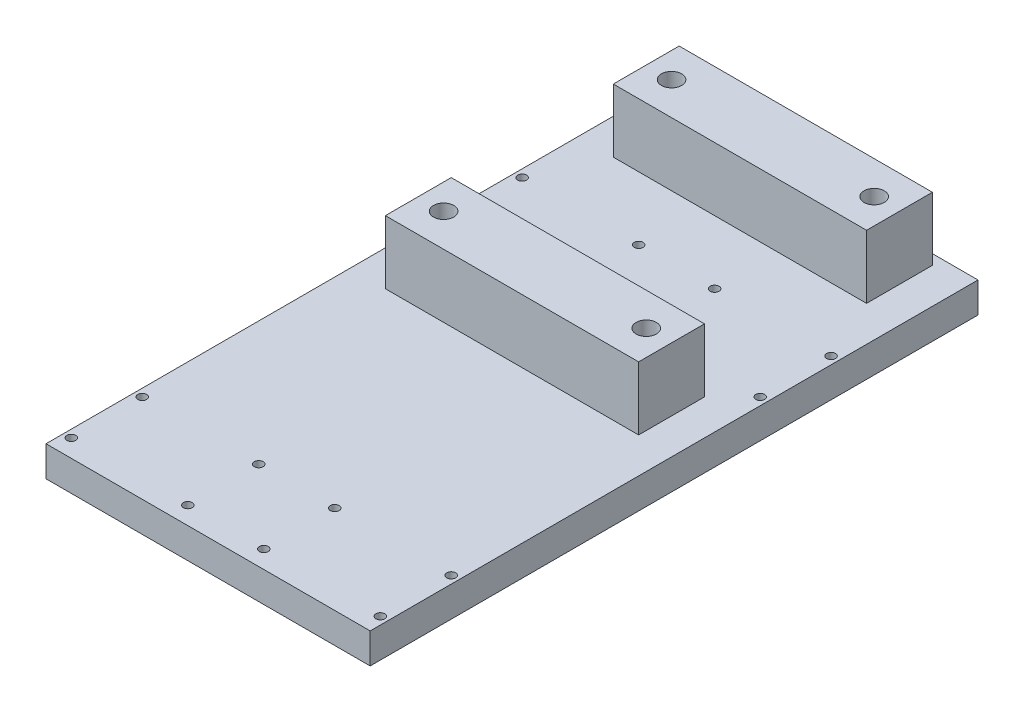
ISO-10303-21;
HEADER;
FILE_DESCRIPTION(('STEP AP214'),'2;1');
FILE_NAME('part.step','',(''),(''),'','','');
FILE_SCHEMA(('AUTOMOTIVE_DESIGN { 1 0 10303 214 1 1 1 1 }'));
ENDSEC;
DATA;
#1=APPLICATION_CONTEXT('core data for automotive mechanical design processes');
#2=APPLICATION_PROTOCOL_DEFINITION('international standard','automotive_design',2000,#1);
#3=PRODUCT_CONTEXT('',#1,'mechanical');
#4=PRODUCT('Part','Part','',(#3));
#5=PRODUCT_RELATED_PRODUCT_CATEGORY('part','',(#4));
#6=PRODUCT_DEFINITION_FORMATION('','',#4);
#7=PRODUCT_DEFINITION_CONTEXT('part definition',#1,'design');
#8=PRODUCT_DEFINITION('design','',#6,#7);
#9=PRODUCT_DEFINITION_SHAPE('','',#8);
#10=(LENGTH_UNIT() NAMED_UNIT(*) SI_UNIT(.MILLI.,.METRE.));
#11=(NAMED_UNIT(*) PLANE_ANGLE_UNIT() SI_UNIT($,.RADIAN.));
#12=(NAMED_UNIT(*) SI_UNIT($,.STERADIAN.) SOLID_ANGLE_UNIT());
#13=UNCERTAINTY_MEASURE_WITH_UNIT(LENGTH_MEASURE(1.E-05),#10,'distance_accuracy_value','');
#14=(GEOMETRIC_REPRESENTATION_CONTEXT(3) GLOBAL_UNCERTAINTY_ASSIGNED_CONTEXT((#13)) GLOBAL_UNIT_ASSIGNED_CONTEXT((#10,
#11,#12)) REPRESENTATION_CONTEXT('',''));
#15=CARTESIAN_POINT('',(0.,0.,0.));
#16=DIRECTION('',(0.,0.,1.));
#17=DIRECTION('',(1.,0.,0.));
#18=AXIS2_PLACEMENT_3D('',#15,#16,#17);
#19=CARTESIAN_POINT('',(101.6,19.05,0.));
#20=DIRECTION('',(0.,1.,0.));
#21=DIRECTION('',(0.,0.,1.));
#22=AXIS2_PLACEMENT_3D('',#19,#20,#21);
#23=PLANE('',#22);
#24=CARTESIAN_POINT('',(23.8125,19.05,325.4375));
#25=DIRECTION('',(0.,1.,0.));
#26=DIRECTION('',(0.,0.,1.));
#27=AXIS2_PLACEMENT_3D('',#24,#25,#26);
#28=CIRCLE('',#27,2.77812499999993);
#29=CARTESIAN_POINT('',(23.8125,19.05,328.215625));
#30=VERTEX_POINT('',#29);
#31=EDGE_CURVE('E385',#30,#30,#28,.T.);
#32=ORIENTED_EDGE('',*,*,#31,.F.);
#33=EDGE_LOOP('',(#32));
#34=FACE_BOUND('',#33,.T.);
#35=CARTESIAN_POINT('',(23.8125,19.05,369.8875));
#36=DIRECTION('',(0.,1.,0.));
#37=DIRECTION('',(0.,0.,1.));
#38=AXIS2_PLACEMENT_3D('',#35,#36,#37);
#39=CIRCLE('',#38,2.77812499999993);
#40=CARTESIAN_POINT('',(23.8125,19.05,372.665625));
#41=VERTEX_POINT('',#40);
#42=EDGE_CURVE('E395',#41,#41,#39,.T.);
#43=ORIENTED_EDGE('',*,*,#42,.F.);
#44=EDGE_LOOP('',(#43));
#45=FACE_BOUND('',#44,.T.);
#46=CARTESIAN_POINT('',(-23.8125000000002,19.05,87.3124999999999));
#47=DIRECTION('',(0.,1.,0.));
#48=DIRECTION('',(0.,0.,1.));
#49=AXIS2_PLACEMENT_3D('',#46,#47,#48);
#50=CIRCLE('',#49,2.77812499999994);
#51=CARTESIAN_POINT('',(-23.8125000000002,19.05,90.0906249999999));
#52=VERTEX_POINT('',#51);
#53=EDGE_CURVE('E401',#52,#52,#50,.T.);
#54=ORIENTED_EDGE('',*,*,#53,.F.);
#55=EDGE_LOOP('',(#54));
#56=FACE_BOUND('',#55,.T.);
#57=CARTESIAN_POINT('',(-23.8125000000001,19.05,131.7625));
#58=DIRECTION('',(0.,1.,0.));
#59=DIRECTION('',(0.,0.,1.));
#60=AXIS2_PLACEMENT_3D('',#57,#58,#59);
#61=CIRCLE('',#60,2.77812499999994);
#62=CARTESIAN_POINT('',(-23.8125000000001,19.05,134.540625));
#63=VERTEX_POINT('',#62);
#64=EDGE_CURVE('E407',#63,#63,#61,.T.);
#65=ORIENTED_EDGE('',*,*,#64,.F.);
#66=EDGE_LOOP('',(#65));
#67=FACE_BOUND('',#66,.T.);
#68=CARTESIAN_POINT('',(-96.8375000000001,19.05,131.7625));
#69=DIRECTION('',(0.,1.,0.));
#70=DIRECTION('',(0.,0.,1.));
#71=AXIS2_PLACEMENT_3D('',#68,#69,#70);
#72=CIRCLE('',#71,2.77812499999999);
#73=CARTESIAN_POINT('',(-96.8375000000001,19.05,134.540625));
#74=VERTEX_POINT('',#73);
#75=EDGE_CURVE('E413',#74,#74,#72,.T.);
#76=ORIENTED_EDGE('',*,*,#75,.F.);
#77=EDGE_LOOP('',(#76));
#78=FACE_BOUND('',#77,.T.);
#79=CARTESIAN_POINT('',(-96.8375000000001,19.05,87.3124999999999));
#80=DIRECTION('',(0.,1.,0.));
#81=DIRECTION('',(0.,0.,1.));
#82=AXIS2_PLACEMENT_3D('',#79,#80,#81);
#83=CIRCLE('',#82,2.77812499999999);
#84=CARTESIAN_POINT('',(-96.8375000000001,19.05,90.0906249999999));
#85=VERTEX_POINT('',#84);
#86=EDGE_CURVE('E419',#85,#85,#83,.T.);
#87=ORIENTED_EDGE('',*,*,#86,.F.);
#88=EDGE_LOOP('',(#87));
#89=FACE_BOUND('',#88,.T.);
#90=CARTESIAN_POINT('',(-23.8125000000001,19.05,325.4375));
#91=DIRECTION('',(0.,1.,0.));
#92=DIRECTION('',(0.,0.,1.));
#93=AXIS2_PLACEMENT_3D('',#90,#91,#92);
#94=CIRCLE('',#93,2.77812499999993);
#95=CARTESIAN_POINT('',(-23.8125000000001,19.05,328.215625));
#96=VERTEX_POINT('',#95);
#97=EDGE_CURVE('E425',#96,#96,#94,.T.);
#98=ORIENTED_EDGE('',*,*,#97,.F.);
#99=EDGE_LOOP('',(#98));
#100=FACE_BOUND('',#99,.T.);
#101=CARTESIAN_POINT('',(-23.8125,19.05,369.8875));
#102=DIRECTION('',(0.,1.,0.));
#103=DIRECTION('',(0.,0.,1.));
#104=AXIS2_PLACEMENT_3D('',#101,#102,#103);
#105=CIRCLE('',#104,2.77812499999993);
#106=CARTESIAN_POINT('',(-23.8125,19.05,372.665625));
#107=VERTEX_POINT('',#106);
#108=EDGE_CURVE('E431',#107,#107,#105,.T.);
#109=ORIENTED_EDGE('',*,*,#108,.F.);
#110=EDGE_LOOP('',(#109));
#111=FACE_BOUND('',#110,.T.);
#112=CARTESIAN_POINT('',(-96.8375,19.05,369.8875));
#113=DIRECTION('',(0.,1.,0.));
#114=DIRECTION('',(0.,0.,1.));
#115=AXIS2_PLACEMENT_3D('',#112,#113,#114);
#116=CIRCLE('',#115,2.77812499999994);
#117=CARTESIAN_POINT('',(-96.8375,19.05,372.665625));
#118=VERTEX_POINT('',#117);
#119=EDGE_CURVE('E437',#118,#118,#116,.T.);
#120=ORIENTED_EDGE('',*,*,#119,.F.);
#121=EDGE_LOOP('',(#120));
#122=FACE_BOUND('',#121,.T.);
#123=CARTESIAN_POINT('',(-96.8375,19.05,325.4375));
#124=DIRECTION('',(0.,1.,0.));
#125=DIRECTION('',(0.,0.,1.));
#126=AXIS2_PLACEMENT_3D('',#123,#124,#125);
#127=CIRCLE('',#126,2.77812499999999);
#128=CARTESIAN_POINT('',(-96.8375,19.05,328.215625));
#129=VERTEX_POINT('',#128);
#130=EDGE_CURVE('E443',#129,#129,#127,.T.);
#131=ORIENTED_EDGE('',*,*,#130,.F.);
#132=EDGE_LOOP('',(#131));
#133=FACE_BOUND('',#132,.T.);
#134=CARTESIAN_POINT('',(23.8125,19.05,131.7625));
#135=DIRECTION('',(0.,1.,0.));
#136=DIRECTION('',(0.,0.,1.));
#137=AXIS2_PLACEMENT_3D('',#134,#135,#136);
#138=CIRCLE('',#137,2.77812499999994);
#139=CARTESIAN_POINT('',(23.8125,19.05,134.540625));
#140=VERTEX_POINT('',#139);
#141=EDGE_CURVE('E449',#140,#140,#138,.T.);
#142=ORIENTED_EDGE('',*,*,#141,.F.);
#143=EDGE_LOOP('',(#142));
#144=FACE_BOUND('',#143,.T.);
#145=CARTESIAN_POINT('',(23.8125,19.05,87.3125));
#146=DIRECTION('',(0.,1.,0.));
#147=DIRECTION('',(0.,0.,1.));
#148=AXIS2_PLACEMENT_3D('',#145,#146,#147);
#149=CIRCLE('',#148,2.77812499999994);
#150=CARTESIAN_POINT('',(23.8125,19.05,90.0906249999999));
#151=VERTEX_POINT('',#150);
#152=EDGE_CURVE('E455',#151,#151,#149,.T.);
#153=ORIENTED_EDGE('',*,*,#152,.F.);
#154=EDGE_LOOP('',(#153));
#155=FACE_BOUND('',#154,.T.);
#156=CARTESIAN_POINT('',(96.8374999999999,19.05,325.4375));
#157=DIRECTION('',(0.,1.,0.));
#158=DIRECTION('',(0.,0.,1.));
#159=AXIS2_PLACEMENT_3D('',#156,#157,#158);
#160=CIRCLE('',#159,2.77812499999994);
#161=CARTESIAN_POINT('',(96.8374999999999,19.05,328.215625));
#162=VERTEX_POINT('',#161);
#163=EDGE_CURVE('E461',#162,#162,#160,.T.);
#164=ORIENTED_EDGE('',*,*,#163,.F.);
#165=EDGE_LOOP('',(#164));
#166=FACE_BOUND('',#165,.T.);
#167=CARTESIAN_POINT('',(96.8375,19.05,369.8875));
#168=DIRECTION('',(0.,1.,0.));
#169=DIRECTION('',(0.,0.,1.));
#170=AXIS2_PLACEMENT_3D('',#167,#168,#169);
#171=CIRCLE('',#170,2.77812499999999);
#172=CARTESIAN_POINT('',(96.8375,19.05,372.665625));
#173=VERTEX_POINT('',#172);
#174=EDGE_CURVE('E467',#173,#173,#171,.T.);
#175=ORIENTED_EDGE('',*,*,#174,.F.);
#176=EDGE_LOOP('',(#175));
#177=FACE_BOUND('',#176,.T.);
#178=CARTESIAN_POINT('',(96.8374999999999,19.05,131.7625));
#179=DIRECTION('',(0.,1.,0.));
#180=DIRECTION('',(0.,0.,1.));
#181=AXIS2_PLACEMENT_3D('',#178,#179,#180);
#182=CIRCLE('',#181,2.778125);
#183=CARTESIAN_POINT('',(96.8374999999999,19.05,134.540625));
#184=VERTEX_POINT('',#183);
#185=EDGE_CURVE('E473',#184,#184,#182,.T.);
#186=ORIENTED_EDGE('',*,*,#185,.F.);
#187=EDGE_LOOP('',(#186));
#188=FACE_BOUND('',#187,.T.);
#189=CARTESIAN_POINT('',(96.8375,19.05,87.3125000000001));
#190=DIRECTION('',(0.,1.,0.));
#191=DIRECTION('',(0.,0.,1.));
#192=AXIS2_PLACEMENT_3D('',#189,#190,#191);
#193=CIRCLE('',#192,2.778125);
#194=CARTESIAN_POINT('',(96.8375,19.05,90.0906250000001));
#195=VERTEX_POINT('',#194);
#196=EDGE_CURVE('E479',#195,#195,#193,.T.);
#197=ORIENTED_EDGE('',*,*,#196,.F.);
#198=EDGE_LOOP('',(#197));
#199=FACE_BOUND('',#198,.T.);
#200=DIRECTION('',(-1.,0.,0.));
#201=VECTOR('',#200,1.);
#202=CARTESIAN_POINT('',(79.375,19.05,47.625));
#203=LINE('',#202,#201);
#204=CARTESIAN_POINT('',(79.375,19.05,47.625));
#205=VERTEX_POINT('',#204);
#206=CARTESIAN_POINT('',(-79.375,19.05,47.625));
#207=VERTEX_POINT('',#206);
#208=EDGE_CURVE('E162',#205,#207,#203,.T.);
#209=ORIENTED_EDGE('',*,*,#208,.T.);
#210=DIRECTION('',(0.,0.,1.));
#211=VECTOR('',#210,1.);
#212=CARTESIAN_POINT('',(-79.375,19.05,6.34999999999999));
#213=LINE('',#212,#211);
#214=CARTESIAN_POINT('',(-79.375,19.05,6.34999999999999));
#215=VERTEX_POINT('',#214);
#216=EDGE_CURVE('E159',#215,#207,#213,.T.);
#217=ORIENTED_EDGE('',*,*,#216,.F.);
#218=DIRECTION('',(1.,0.,0.));
#219=VECTOR('',#218,1.);
#220=CARTESIAN_POINT('',(-79.375,19.05,6.34999999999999));
#221=LINE('',#220,#219);
#222=CARTESIAN_POINT('',(79.375,19.05,6.35000000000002));
#223=VERTEX_POINT('',#222);
#224=EDGE_CURVE('E167',#215,#223,#221,.T.);
#225=ORIENTED_EDGE('',*,*,#224,.T.);
#226=DIRECTION('',(0.,0.,-1.));
#227=VECTOR('',#226,1.);
#228=CARTESIAN_POINT('',(79.375,19.05,47.625));
#229=LINE('',#228,#227);
#230=EDGE_CURVE('E164',#205,#223,#229,.T.);
#231=ORIENTED_EDGE('',*,*,#230,.F.);
#232=EDGE_LOOP('',(#209,#217,#225,#231));
#233=FACE_BOUND('',#232,.T.);
#234=DIRECTION('',(0.,0.,1.));
#235=VECTOR('',#234,1.);
#236=CARTESIAN_POINT('',(101.6,19.05,0.));
#237=LINE('',#236,#235);
#238=CARTESIAN_POINT('',(101.6,19.05,0.));
#239=VERTEX_POINT('',#238);
#240=CARTESIAN_POINT('',(101.6,19.05,381.));
#241=VERTEX_POINT('',#240);
#242=EDGE_CURVE('E203',#239,#241,#237,.T.);
#243=ORIENTED_EDGE('',*,*,#242,.F.);
#244=DIRECTION('',(1.,0.,0.));
#245=VECTOR('',#244,1.);
#246=CARTESIAN_POINT('',(-101.6,19.05,0.));
#247=LINE('',#246,#245);
#248=CARTESIAN_POINT('',(-101.6,19.05,0.));
#249=VERTEX_POINT('',#248);
#250=EDGE_CURVE('E211',#249,#239,#247,.T.);
#251=ORIENTED_EDGE('',*,*,#250,.F.);
#252=DIRECTION('',(0.,0.,1.));
#253=VECTOR('',#252,1.);
#254=CARTESIAN_POINT('',(-101.6,19.05,0.));
#255=LINE('',#254,#253);
#256=CARTESIAN_POINT('',(-101.6,19.05,381.));
#257=VERTEX_POINT('',#256);
#258=EDGE_CURVE('E209',#249,#257,#255,.T.);
#259=ORIENTED_EDGE('',*,*,#258,.T.);
#260=DIRECTION('',(-1.,0.,0.));
#261=VECTOR('',#260,1.);
#262=CARTESIAN_POINT('',(101.6,19.05,381.));
#263=LINE('',#262,#261);
#264=EDGE_CURVE('E206',#241,#257,#263,.T.);
#265=ORIENTED_EDGE('',*,*,#264,.F.);
#266=EDGE_LOOP('',(#243,#251,#259,#265));
#267=FACE_BOUND('',#266,.T.);
#268=DIRECTION('',(-1.,0.,0.));
#269=VECTOR('',#268,1.);
#270=CARTESIAN_POINT('',(79.375,19.05,190.5));
#271=LINE('',#270,#269);
#272=CARTESIAN_POINT('',(79.375,19.05,190.5));
#273=VERTEX_POINT('',#272);
#274=CARTESIAN_POINT('',(-79.375,19.05,190.5));
#275=VERTEX_POINT('',#274);
#276=EDGE_CURVE('E47',#273,#275,#271,.T.);
#277=ORIENTED_EDGE('',*,*,#276,.T.);
#278=DIRECTION('',(0.,0.,1.));
#279=VECTOR('',#278,1.);
#280=CARTESIAN_POINT('',(-79.375,19.05,149.225));
#281=LINE('',#280,#279);
#282=CARTESIAN_POINT('',(-79.375,19.05,149.225));
#283=VERTEX_POINT('',#282);
#284=EDGE_CURVE('E141',#283,#275,#281,.T.);
#285=ORIENTED_EDGE('',*,*,#284,.F.);
#286=DIRECTION('',(1.,0.,0.));
#287=VECTOR('',#286,1.);
#288=CARTESIAN_POINT('',(-79.375,19.05,149.225));
#289=LINE('',#288,#287);
#290=CARTESIAN_POINT('',(79.375,19.05,149.225));
#291=VERTEX_POINT('',#290);
#292=EDGE_CURVE('E482',#283,#291,#289,.T.);
#293=ORIENTED_EDGE('',*,*,#292,.T.);
#294=DIRECTION('',(0.,0.,-1.));
#295=VECTOR('',#294,1.);
#296=CARTESIAN_POINT('',(79.375,19.05,190.5));
#297=LINE('',#296,#295);
#298=EDGE_CURVE('E52',#273,#291,#297,.T.);
#299=ORIENTED_EDGE('',*,*,#298,.F.);
#300=EDGE_LOOP('',(#277,#285,#293,#299));
#301=FACE_BOUND('',#300,.T.);
#302=ADVANCED_FACE('F30',(#34,#45,#56,#67,#78,#89,#100,#111,#122,#133,#144,#155,#166,#177,#188,
#199,#233,#267,#301),#23,.T.);
#303=CARTESIAN_POINT('',(-79.375,58.7375,6.34999999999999));
#304=DIRECTION('',(0.,1.,0.));
#305=DIRECTION('',(0.,0.,1.));
#306=AXIS2_PLACEMENT_3D('',#303,#304,#305);
#307=PLANE('',#306);
#308=DIRECTION('',(0.,0.,1.));
#309=VECTOR('',#308,1.);
#310=CARTESIAN_POINT('',(-79.375,58.7375,6.34999999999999));
#311=LINE('',#310,#309);
#312=CARTESIAN_POINT('',(-79.375,58.7375,6.34999999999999));
#313=VERTEX_POINT('',#312);
#314=CARTESIAN_POINT('',(-79.375,58.7375,47.625));
#315=VERTEX_POINT('',#314);
#316=EDGE_CURVE('E169',#313,#315,#311,.T.);
#317=ORIENTED_EDGE('',*,*,#316,.T.);
#318=DIRECTION('',(-1.,0.,0.));
#319=VECTOR('',#318,1.);
#320=CARTESIAN_POINT('',(79.375,58.7375,47.625));
#321=LINE('',#320,#319);
#322=CARTESIAN_POINT('',(79.375,58.7375,47.625));
#323=VERTEX_POINT('',#322);
#324=EDGE_CURVE('E171',#323,#315,#321,.T.);
#325=ORIENTED_EDGE('',*,*,#324,.F.);
#326=DIRECTION('',(0.,0.,-1.));
#327=VECTOR('',#326,1.);
#328=CARTESIAN_POINT('',(79.375,58.7375,47.625));
#329=LINE('',#328,#327);
#330=CARTESIAN_POINT('',(79.375,58.7375,6.35000000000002));
#331=VERTEX_POINT('',#330);
#332=EDGE_CURVE('E174',#323,#331,#329,.T.);
#333=ORIENTED_EDGE('',*,*,#332,.T.);
#334=DIRECTION('',(1.,0.,0.));
#335=VECTOR('',#334,1.);
#336=CARTESIAN_POINT('',(-79.375,58.7375,6.34999999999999));
#337=LINE('',#336,#335);
#338=EDGE_CURVE('E176',#313,#331,#337,.T.);
#339=ORIENTED_EDGE('',*,*,#338,.F.);
#340=EDGE_LOOP('',(#317,#325,#333,#339));
#341=FACE_BOUND('',#340,.T.);
#342=CARTESIAN_POINT('',(63.5,58.7375,26.9875));
#343=DIRECTION('',(0.,1.,0.));
#344=DIRECTION('',(0.,0.,1.));
#345=AXIS2_PLACEMENT_3D('',#342,#343,#344);
#346=CIRCLE('',#345,6.35);
#347=CARTESIAN_POINT('',(63.5,58.7375,33.3375));
#348=VERTEX_POINT('',#347);
#349=EDGE_CURVE('E153',#348,#348,#346,.T.);
#350=ORIENTED_EDGE('',*,*,#349,.F.);
#351=EDGE_LOOP('',(#350));
#352=FACE_BOUND('',#351,.T.);
#353=CARTESIAN_POINT('',(-63.5,58.7375,26.9875));
#354=DIRECTION('',(0.,-1.,0.));
#355=DIRECTION('',(0.,0.,-1.));
#356=AXIS2_PLACEMENT_3D('',#353,#354,#355);
#357=CIRCLE('',#356,6.35000000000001);
#358=CARTESIAN_POINT('',(-63.5,58.7375,33.3375));
#359=VERTEX_POINT('',#358);
#360=EDGE_CURVE('E143',#359,#359,#357,.T.);
#361=ORIENTED_EDGE('',*,*,#360,.T.);
#362=EDGE_LOOP('',(#361));
#363=FACE_BOUND('',#362,.T.);
#364=ADVANCED_FACE('F242',(#341,#352,#363),#307,.T.);
#365=CARTESIAN_POINT('',(101.6,19.05,0.));
#366=DIRECTION('',(1.,0.,0.));
#367=DIRECTION('',(0.,0.,-1.));
#368=AXIS2_PLACEMENT_3D('',#365,#366,#367);
#369=PLANE('',#368);
#370=DIRECTION('',(0.,0.,1.));
#371=VECTOR('',#370,1.);
#372=CARTESIAN_POINT('',(101.6,0.,0.));
#373=LINE('',#372,#371);
#374=CARTESIAN_POINT('',(101.6,0.,0.));
#375=VERTEX_POINT('',#374);
#376=CARTESIAN_POINT('',(101.6,0.,381.));
#377=VERTEX_POINT('',#376);
#378=EDGE_CURVE('E191',#375,#377,#373,.T.);
#379=ORIENTED_EDGE('',*,*,#378,.F.);
#380=DIRECTION('',(0.,-1.,0.));
#381=VECTOR('',#380,1.);
#382=CARTESIAN_POINT('',(101.6,19.05,0.));
#383=LINE('',#382,#381);
#384=EDGE_CURVE('E11',#239,#375,#383,.T.);
#385=ORIENTED_EDGE('',*,*,#384,.F.);
#386=ORIENTED_EDGE('',*,*,#242,.T.);
#387=DIRECTION('',(0.,-1.,0.));
#388=VECTOR('',#387,1.);
#389=CARTESIAN_POINT('',(101.6,19.05,381.));
#390=LINE('',#389,#388);
#391=EDGE_CURVE('E34',#241,#377,#390,.T.);
#392=ORIENTED_EDGE('',*,*,#391,.T.);
#393=EDGE_LOOP('',(#379,#385,#386,#392));
#394=FACE_BOUND('',#393,.T.);
#395=ADVANCED_FACE('F32',(#394),#369,.T.);
#396=CARTESIAN_POINT('',(-101.6,19.05,0.));
#397=DIRECTION('',(0.,0.,-1.));
#398=DIRECTION('',(-1.,0.,0.));
#399=AXIS2_PLACEMENT_3D('',#396,#397,#398);
#400=PLANE('',#399);
#401=DIRECTION('',(1.,0.,0.));
#402=VECTOR('',#401,1.);
#403=CARTESIAN_POINT('',(-101.6,0.,0.));
#404=LINE('',#403,#402);
#405=CARTESIAN_POINT('',(-101.6,0.,0.));
#406=VERTEX_POINT('',#405);
#407=EDGE_CURVE('E200',#406,#375,#404,.T.);
#408=ORIENTED_EDGE('',*,*,#407,.F.);
#409=DIRECTION('',(0.,-1.,0.));
#410=VECTOR('',#409,1.);
#411=CARTESIAN_POINT('',(-101.6,19.05,0.));
#412=LINE('',#411,#410);
#413=EDGE_CURVE('E39',#249,#406,#412,.T.);
#414=ORIENTED_EDGE('',*,*,#413,.F.);
#415=ORIENTED_EDGE('',*,*,#250,.T.);
#416=ORIENTED_EDGE('',*,*,#384,.T.);
#417=EDGE_LOOP('',(#408,#414,#415,#416));
#418=FACE_BOUND('',#417,.T.);
#419=ADVANCED_FACE('F228',(#418),#400,.T.);
#420=CARTESIAN_POINT('',(-101.6,19.05,0.));
#421=DIRECTION('',(1.,0.,0.));
#422=DIRECTION('',(0.,0.,-1.));
#423=AXIS2_PLACEMENT_3D('',#420,#421,#422);
#424=PLANE('',#423);
#425=DIRECTION('',(0.,0.,1.));
#426=VECTOR('',#425,1.);
#427=CARTESIAN_POINT('',(-101.6,0.,0.));
#428=LINE('',#427,#426);
#429=CARTESIAN_POINT('',(-101.6,0.,381.));
#430=VERTEX_POINT('',#429);
#431=EDGE_CURVE('E197',#406,#430,#428,.T.);
#432=ORIENTED_EDGE('',*,*,#431,.T.);
#433=DIRECTION('',(0.,-1.,0.));
#434=VECTOR('',#433,1.);
#435=CARTESIAN_POINT('',(-101.6,19.05,381.));
#436=LINE('',#435,#434);
#437=EDGE_CURVE('E214',#257,#430,#436,.T.);
#438=ORIENTED_EDGE('',*,*,#437,.F.);
#439=ORIENTED_EDGE('',*,*,#258,.F.);
#440=ORIENTED_EDGE('',*,*,#413,.T.);
#441=EDGE_LOOP('',(#432,#438,#439,#440));
#442=FACE_BOUND('',#441,.T.);
#443=ADVANCED_FACE('F233',(#442),#424,.F.);
#444=CARTESIAN_POINT('',(101.6,19.05,381.));
#445=DIRECTION('',(0.,0.,1.));
#446=DIRECTION('',(1.,0.,0.));
#447=AXIS2_PLACEMENT_3D('',#444,#445,#446);
#448=PLANE('',#447);
#449=DIRECTION('',(-1.,0.,0.));
#450=VECTOR('',#449,1.);
#451=CARTESIAN_POINT('',(101.6,0.,381.));
#452=LINE('',#451,#450);
#453=EDGE_CURVE('E194',#377,#430,#452,.T.);
#454=ORIENTED_EDGE('',*,*,#453,.F.);
#455=ORIENTED_EDGE('',*,*,#391,.F.);
#456=ORIENTED_EDGE('',*,*,#264,.T.);
#457=ORIENTED_EDGE('',*,*,#437,.T.);
#458=EDGE_LOOP('',(#454,#455,#456,#457));
#459=FACE_BOUND('',#458,.T.);
#460=ADVANCED_FACE('F222',(#459),#448,.T.);
#461=CARTESIAN_POINT('',(101.6,0.,0.));
#462=DIRECTION('',(0.,1.,0.));
#463=DIRECTION('',(0.,0.,1.));
#464=AXIS2_PLACEMENT_3D('',#461,#462,#463);
#465=PLANE('',#464);
#466=CARTESIAN_POINT('',(23.8125,0.,325.4375));
#467=DIRECTION('',(0.,-1.,0.));
#468=DIRECTION('',(0.,0.,-1.));
#469=AXIS2_PLACEMENT_3D('',#466,#467,#468);
#470=CIRCLE('',#469,2.77812499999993);
#471=CARTESIAN_POINT('',(23.8125,0.,322.659375));
#472=VERTEX_POINT('',#471);
#473=EDGE_CURVE('E388',#472,#472,#470,.T.);
#474=ORIENTED_EDGE('',*,*,#473,.F.);
#475=EDGE_LOOP('',(#474));
#476=FACE_BOUND('',#475,.T.);
#477=CARTESIAN_POINT('',(23.8125,0.,369.8875));
#478=DIRECTION('',(0.,-1.,0.));
#479=DIRECTION('',(0.,0.,-1.));
#480=AXIS2_PLACEMENT_3D('',#477,#478,#479);
#481=CIRCLE('',#480,2.77812499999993);
#482=CARTESIAN_POINT('',(23.8125,0.,367.109375));
#483=VERTEX_POINT('',#482);
#484=EDGE_CURVE('E390',#483,#483,#481,.T.);
#485=ORIENTED_EDGE('',*,*,#484,.F.);
#486=EDGE_LOOP('',(#485));
#487=FACE_BOUND('',#486,.T.);
#488=CARTESIAN_POINT('',(-23.8125000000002,0.,87.3124999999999));
#489=DIRECTION('',(0.,-1.,0.));
#490=DIRECTION('',(0.,0.,-1.));
#491=AXIS2_PLACEMENT_3D('',#488,#489,#490);
#492=CIRCLE('',#491,2.77812499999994);
#493=CARTESIAN_POINT('',(-23.8125000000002,0.,84.534375));
#494=VERTEX_POINT('',#493);
#495=EDGE_CURVE('E398',#494,#494,#492,.T.);
#496=ORIENTED_EDGE('',*,*,#495,.F.);
#497=EDGE_LOOP('',(#496));
#498=FACE_BOUND('',#497,.T.);
#499=CARTESIAN_POINT('',(-23.8125000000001,0.,131.7625));
#500=DIRECTION('',(0.,-1.,0.));
#501=DIRECTION('',(0.,0.,-1.));
#502=AXIS2_PLACEMENT_3D('',#499,#500,#501);
#503=CIRCLE('',#502,2.77812499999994);
#504=CARTESIAN_POINT('',(-23.8125000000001,0.,128.984375));
#505=VERTEX_POINT('',#504);
#506=EDGE_CURVE('E404',#505,#505,#503,.T.);
#507=ORIENTED_EDGE('',*,*,#506,.F.);
#508=EDGE_LOOP('',(#507));
#509=FACE_BOUND('',#508,.T.);
#510=CARTESIAN_POINT('',(-96.8375000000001,0.,131.7625));
#511=DIRECTION('',(0.,-1.,0.));
#512=DIRECTION('',(0.,0.,-1.));
#513=AXIS2_PLACEMENT_3D('',#510,#511,#512);
#514=CIRCLE('',#513,2.77812499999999);
#515=CARTESIAN_POINT('',(-96.8375000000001,0.,128.984375));
#516=VERTEX_POINT('',#515);
#517=EDGE_CURVE('E410',#516,#516,#514,.T.);
#518=ORIENTED_EDGE('',*,*,#517,.F.);
#519=EDGE_LOOP('',(#518));
#520=FACE_BOUND('',#519,.T.);
#521=CARTESIAN_POINT('',(-96.8375000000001,0.,87.3124999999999));
#522=DIRECTION('',(0.,-1.,0.));
#523=DIRECTION('',(0.,0.,-1.));
#524=AXIS2_PLACEMENT_3D('',#521,#522,#523);
#525=CIRCLE('',#524,2.77812499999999);
#526=CARTESIAN_POINT('',(-96.8375000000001,0.,84.5343749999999));
#527=VERTEX_POINT('',#526);
#528=EDGE_CURVE('E416',#527,#527,#525,.T.);
#529=ORIENTED_EDGE('',*,*,#528,.F.);
#530=EDGE_LOOP('',(#529));
#531=FACE_BOUND('',#530,.T.);
#532=CARTESIAN_POINT('',(-23.8125000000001,0.,325.4375));
#533=DIRECTION('',(0.,-1.,0.));
#534=DIRECTION('',(0.,0.,-1.));
#535=AXIS2_PLACEMENT_3D('',#532,#533,#534);
#536=CIRCLE('',#535,2.77812499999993);
#537=CARTESIAN_POINT('',(-23.8125000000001,0.,322.659375));
#538=VERTEX_POINT('',#537);
#539=EDGE_CURVE('E422',#538,#538,#536,.T.);
#540=ORIENTED_EDGE('',*,*,#539,.F.);
#541=EDGE_LOOP('',(#540));
#542=FACE_BOUND('',#541,.T.);
#543=CARTESIAN_POINT('',(-23.8125,0.,369.8875));
#544=DIRECTION('',(0.,-1.,0.));
#545=DIRECTION('',(0.,0.,-1.));
#546=AXIS2_PLACEMENT_3D('',#543,#544,#545);
#547=CIRCLE('',#546,2.77812499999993);
#548=CARTESIAN_POINT('',(-23.8125,0.,367.109375));
#549=VERTEX_POINT('',#548);
#550=EDGE_CURVE('E428',#549,#549,#547,.T.);
#551=ORIENTED_EDGE('',*,*,#550,.F.);
#552=EDGE_LOOP('',(#551));
#553=FACE_BOUND('',#552,.T.);
#554=CARTESIAN_POINT('',(-96.8375,0.,369.8875));
#555=DIRECTION('',(0.,-1.,0.));
#556=DIRECTION('',(0.,0.,-1.));
#557=AXIS2_PLACEMENT_3D('',#554,#555,#556);
#558=CIRCLE('',#557,2.77812499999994);
#559=CARTESIAN_POINT('',(-96.8375,0.,367.109375));
#560=VERTEX_POINT('',#559);
#561=EDGE_CURVE('E434',#560,#560,#558,.T.);
#562=ORIENTED_EDGE('',*,*,#561,.F.);
#563=EDGE_LOOP('',(#562));
#564=FACE_BOUND('',#563,.T.);
#565=CARTESIAN_POINT('',(-96.8375,0.,325.4375));
#566=DIRECTION('',(0.,-1.,0.));
#567=DIRECTION('',(0.,0.,-1.));
#568=AXIS2_PLACEMENT_3D('',#565,#566,#567);
#569=CIRCLE('',#568,2.77812499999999);
#570=CARTESIAN_POINT('',(-96.8375,0.,322.659375));
#571=VERTEX_POINT('',#570);
#572=EDGE_CURVE('E440',#571,#571,#569,.T.);
#573=ORIENTED_EDGE('',*,*,#572,.F.);
#574=EDGE_LOOP('',(#573));
#575=FACE_BOUND('',#574,.T.);
#576=CARTESIAN_POINT('',(23.8125,0.,131.7625));
#577=DIRECTION('',(0.,-1.,0.));
#578=DIRECTION('',(0.,0.,-1.));
#579=AXIS2_PLACEMENT_3D('',#576,#577,#578);
#580=CIRCLE('',#579,2.77812499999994);
#581=CARTESIAN_POINT('',(23.8125,0.,128.984375));
#582=VERTEX_POINT('',#581);
#583=EDGE_CURVE('E446',#582,#582,#580,.T.);
#584=ORIENTED_EDGE('',*,*,#583,.F.);
#585=EDGE_LOOP('',(#584));
#586=FACE_BOUND('',#585,.T.);
#587=CARTESIAN_POINT('',(23.8125,0.,87.3125));
#588=DIRECTION('',(0.,-1.,0.));
#589=DIRECTION('',(0.,0.,-1.));
#590=AXIS2_PLACEMENT_3D('',#587,#588,#589);
#591=CIRCLE('',#590,2.77812499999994);
#592=CARTESIAN_POINT('',(23.8125,0.,84.534375));
#593=VERTEX_POINT('',#592);
#594=EDGE_CURVE('E452',#593,#593,#591,.T.);
#595=ORIENTED_EDGE('',*,*,#594,.F.);
#596=EDGE_LOOP('',(#595));
#597=FACE_BOUND('',#596,.T.);
#598=CARTESIAN_POINT('',(96.8374999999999,0.,325.4375));
#599=DIRECTION('',(0.,-1.,0.));
#600=DIRECTION('',(0.,0.,-1.));
#601=AXIS2_PLACEMENT_3D('',#598,#599,#600);
#602=CIRCLE('',#601,2.77812499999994);
#603=CARTESIAN_POINT('',(96.8374999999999,0.,322.659375));
#604=VERTEX_POINT('',#603);
#605=EDGE_CURVE('E458',#604,#604,#602,.T.);
#606=ORIENTED_EDGE('',*,*,#605,.F.);
#607=EDGE_LOOP('',(#606));
#608=FACE_BOUND('',#607,.T.);
#609=CARTESIAN_POINT('',(96.8375,0.,369.8875));
#610=DIRECTION('',(0.,-1.,0.));
#611=DIRECTION('',(0.,0.,-1.));
#612=AXIS2_PLACEMENT_3D('',#609,#610,#611);
#613=CIRCLE('',#612,2.77812499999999);
#614=CARTESIAN_POINT('',(96.8375,0.,367.109375));
#615=VERTEX_POINT('',#614);
#616=EDGE_CURVE('E464',#615,#615,#613,.T.);
#617=ORIENTED_EDGE('',*,*,#616,.F.);
#618=EDGE_LOOP('',(#617));
#619=FACE_BOUND('',#618,.T.);
#620=CARTESIAN_POINT('',(96.8374999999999,0.,131.7625));
#621=DIRECTION('',(0.,-1.,0.));
#622=DIRECTION('',(0.,0.,-1.));
#623=AXIS2_PLACEMENT_3D('',#620,#621,#622);
#624=CIRCLE('',#623,2.778125);
#625=CARTESIAN_POINT('',(96.8374999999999,0.,128.984375));
#626=VERTEX_POINT('',#625);
#627=EDGE_CURVE('E470',#626,#626,#624,.T.);
#628=ORIENTED_EDGE('',*,*,#627,.F.);
#629=EDGE_LOOP('',(#628));
#630=FACE_BOUND('',#629,.T.);
#631=CARTESIAN_POINT('',(96.8375,0.,87.3125000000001));
#632=DIRECTION('',(0.,-1.,0.));
#633=DIRECTION('',(0.,0.,-1.));
#634=AXIS2_PLACEMENT_3D('',#631,#632,#633);
#635=CIRCLE('',#634,2.778125);
#636=CARTESIAN_POINT('',(96.8375,0.,84.5343750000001));
#637=VERTEX_POINT('',#636);
#638=EDGE_CURVE('E476',#637,#637,#635,.T.);
#639=ORIENTED_EDGE('',*,*,#638,.F.);
#640=EDGE_LOOP('',(#639));
#641=FACE_BOUND('',#640,.T.);
#642=ORIENTED_EDGE('',*,*,#378,.T.);
#643=ORIENTED_EDGE('',*,*,#453,.T.);
#644=ORIENTED_EDGE('',*,*,#431,.F.);
#645=ORIENTED_EDGE('',*,*,#407,.T.);
#646=EDGE_LOOP('',(#642,#643,#644,#645));
#647=FACE_BOUND('',#646,.T.);
#648=ADVANCED_FACE('F225',(#476,#487,#498,#509,#520,#531,#542,#553,#564,#575,#586,#597,#608,
#619,#630,#641,#647),#465,.F.);
#649=CARTESIAN_POINT('',(-79.375,58.7375,6.34999999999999));
#650=DIRECTION('',(1.,0.,0.));
#651=DIRECTION('',(0.,0.,-1.));
#652=AXIS2_PLACEMENT_3D('',#649,#650,#651);
#653=PLANE('',#652);
#654=ORIENTED_EDGE('',*,*,#216,.T.);
#655=DIRECTION('',(0.,-1.,0.));
#656=VECTOR('',#655,1.);
#657=CARTESIAN_POINT('',(-79.375,58.7375,47.625));
#658=LINE('',#657,#656);
#659=EDGE_CURVE('E188',#315,#207,#658,.T.);
#660=ORIENTED_EDGE('',*,*,#659,.F.);
#661=ORIENTED_EDGE('',*,*,#316,.F.);
#662=DIRECTION('',(0.,-1.,0.));
#663=VECTOR('',#662,1.);
#664=CARTESIAN_POINT('',(-79.375,58.7375,6.34999999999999));
#665=LINE('',#664,#663);
#666=EDGE_CURVE('E179',#313,#215,#665,.T.);
#667=ORIENTED_EDGE('',*,*,#666,.T.);
#668=EDGE_LOOP('',(#654,#660,#661,#667));
#669=FACE_BOUND('',#668,.T.);
#670=ADVANCED_FACE('F256',(#669),#653,.F.);
#671=CARTESIAN_POINT('',(79.375,58.7375,47.625));
#672=DIRECTION('',(0.,0.,1.));
#673=DIRECTION('',(1.,0.,0.));
#674=AXIS2_PLACEMENT_3D('',#671,#672,#673);
#675=PLANE('',#674);
#676=ORIENTED_EDGE('',*,*,#208,.F.);
#677=DIRECTION('',(0.,-1.,0.));
#678=VECTOR('',#677,1.);
#679=CARTESIAN_POINT('',(79.375,58.7375,47.625));
#680=LINE('',#679,#678);
#681=EDGE_CURVE('E185',#323,#205,#680,.T.);
#682=ORIENTED_EDGE('',*,*,#681,.F.);
#683=ORIENTED_EDGE('',*,*,#324,.T.);
#684=ORIENTED_EDGE('',*,*,#659,.T.);
#685=EDGE_LOOP('',(#676,#682,#683,#684));
#686=FACE_BOUND('',#685,.T.);
#687=ADVANCED_FACE('F260',(#686),#675,.T.);
#688=CARTESIAN_POINT('',(79.375,58.7375,47.625));
#689=DIRECTION('',(-1.,0.,0.));
#690=DIRECTION('',(0.,0.,1.));
#691=AXIS2_PLACEMENT_3D('',#688,#689,#690);
#692=PLANE('',#691);
#693=ORIENTED_EDGE('',*,*,#230,.T.);
#694=DIRECTION('',(0.,-1.,0.));
#695=VECTOR('',#694,1.);
#696=CARTESIAN_POINT('',(79.375,58.7375,6.35000000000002));
#697=LINE('',#696,#695);
#698=EDGE_CURVE('E182',#331,#223,#697,.T.);
#699=ORIENTED_EDGE('',*,*,#698,.F.);
#700=ORIENTED_EDGE('',*,*,#332,.F.);
#701=ORIENTED_EDGE('',*,*,#681,.T.);
#702=EDGE_LOOP('',(#693,#699,#700,#701));
#703=FACE_BOUND('',#702,.T.);
#704=ADVANCED_FACE('F264',(#703),#692,.F.);
#705=CARTESIAN_POINT('',(-79.375,58.7375,6.34999999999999));
#706=DIRECTION('',(0.,0.,-1.));
#707=DIRECTION('',(-1.,0.,0.));
#708=AXIS2_PLACEMENT_3D('',#705,#706,#707);
#709=PLANE('',#708);
#710=ORIENTED_EDGE('',*,*,#224,.F.);
#711=ORIENTED_EDGE('',*,*,#666,.F.);
#712=ORIENTED_EDGE('',*,*,#338,.T.);
#713=ORIENTED_EDGE('',*,*,#698,.T.);
#714=EDGE_LOOP('',(#710,#711,#712,#713));
#715=FACE_BOUND('',#714,.T.);
#716=ADVANCED_FACE('F268',(#715),#709,.T.);
#717=CARTESIAN_POINT('',(63.5,20.6375,26.9875));
#718=DIRECTION('',(0.,1.,0.));
#719=DIRECTION('',(0.,0.,1.));
#720=AXIS2_PLACEMENT_3D('',#717,#718,#719);
#721=CYLINDRICAL_SURFACE('',#720,6.35);
#722=CARTESIAN_POINT('',(63.5,20.6375,26.9875));
#723=DIRECTION('',(0.,1.,0.));
#724=DIRECTION('',(0.,0.,1.));
#725=AXIS2_PLACEMENT_3D('',#722,#723,#724);
#726=CIRCLE('',#725,6.35);
#727=CARTESIAN_POINT('',(63.5,20.6375,33.3375));
#728=VERTEX_POINT('',#727);
#729=EDGE_CURVE('E156',#728,#728,#726,.T.);
#730=CARTESIAN_POINT('',(63.5,20.6375,33.3375));
#731=CARTESIAN_POINT('',(63.5,21.034375,33.3375));
#732=CARTESIAN_POINT('',(63.5,21.43125,33.3375));
#733=CARTESIAN_POINT('',(63.5,22.225,33.3375));
#734=CARTESIAN_POINT('',(63.5,22.621875,33.3375));
#735=CARTESIAN_POINT('',(63.5,23.415625,33.3375));
#736=CARTESIAN_POINT('',(63.5,23.8125,33.3375));
#737=CARTESIAN_POINT('',(63.5,24.60625,33.3375));
#738=CARTESIAN_POINT('',(63.5,25.003125,33.3375));
#739=CARTESIAN_POINT('',(63.5,25.796875,33.3375));
#740=CARTESIAN_POINT('',(63.5,26.19375,33.3375));
#741=CARTESIAN_POINT('',(63.5,26.9875,33.3375));
#742=CARTESIAN_POINT('',(63.5,27.384375,33.3375));
#743=CARTESIAN_POINT('',(63.5,28.178125,33.3375));
#744=CARTESIAN_POINT('',(63.5,28.575,33.3375));
#745=CARTESIAN_POINT('',(63.5,29.36875,33.3375));
#746=CARTESIAN_POINT('',(63.5,29.765625,33.3375));
#747=CARTESIAN_POINT('',(63.5,30.559375,33.3375));
#748=CARTESIAN_POINT('',(63.5,30.95625,33.3375));
#749=CARTESIAN_POINT('',(63.5,31.75,33.3375));
#750=CARTESIAN_POINT('',(63.5,32.146875,33.3375));
#751=CARTESIAN_POINT('',(63.5,32.940625,33.3375));
#752=CARTESIAN_POINT('',(63.5,33.3375,33.3375));
#753=CARTESIAN_POINT('',(63.5,34.13125,33.3375));
#754=CARTESIAN_POINT('',(63.5,34.528125,33.3375));
#755=CARTESIAN_POINT('',(63.5,35.321875,33.3375));
#756=CARTESIAN_POINT('',(63.5,35.71875,33.3375));
#757=CARTESIAN_POINT('',(63.5,36.5125,33.3375));
#758=CARTESIAN_POINT('',(63.5,36.909375,33.3375));
#759=CARTESIAN_POINT('',(63.5,37.703125,33.3375));
#760=CARTESIAN_POINT('',(63.5,38.1,33.3375));
#761=CARTESIAN_POINT('',(63.5,38.89375,33.3375));
#762=CARTESIAN_POINT('',(63.5,39.290625,33.3375));
#763=CARTESIAN_POINT('',(63.5,40.084375,33.3375));
#764=CARTESIAN_POINT('',(63.5,40.48125,33.3375));
#765=CARTESIAN_POINT('',(63.5,41.275,33.3375));
#766=CARTESIAN_POINT('',(63.5,41.671875,33.3375));
#767=CARTESIAN_POINT('',(63.5,42.465625,33.3375));
#768=CARTESIAN_POINT('',(63.5,42.8625,33.3375));
#769=CARTESIAN_POINT('',(63.5,43.65625,33.3375));
#770=CARTESIAN_POINT('',(63.5,44.053125,33.3375));
#771=CARTESIAN_POINT('',(63.5,44.846875,33.3375));
#772=CARTESIAN_POINT('',(63.5,45.24375,33.3375));
#773=CARTESIAN_POINT('',(63.5,46.0375,33.3375));
#774=CARTESIAN_POINT('',(63.5,46.434375,33.3375));
#775=CARTESIAN_POINT('',(63.5,47.228125,33.3375));
#776=CARTESIAN_POINT('',(63.5,47.625,33.3375));
#777=CARTESIAN_POINT('',(63.5,48.41875,33.3375));
#778=CARTESIAN_POINT('',(63.5,48.815625,33.3375));
#779=CARTESIAN_POINT('',(63.5,49.609375,33.3375));
#780=CARTESIAN_POINT('',(63.5,50.00625,33.3375));
#781=CARTESIAN_POINT('',(63.5,50.8,33.3375));
#782=CARTESIAN_POINT('',(63.5,51.196875,33.3375));
#783=CARTESIAN_POINT('',(63.5,51.990625,33.3375));
#784=CARTESIAN_POINT('',(63.5,52.3875,33.3375));
#785=CARTESIAN_POINT('',(63.5,53.18125,33.3375));
#786=CARTESIAN_POINT('',(63.5,53.578125,33.3375));
#787=CARTESIAN_POINT('',(63.5,54.371875,33.3375));
#788=CARTESIAN_POINT('',(63.5,54.76875,33.3375));
#789=CARTESIAN_POINT('',(63.5,55.5625,33.3375));
#790=CARTESIAN_POINT('',(63.5,55.959375,33.3375));
#791=CARTESIAN_POINT('',(63.5,56.753125,33.3375));
#792=CARTESIAN_POINT('',(63.5,57.15,33.3375));
#793=CARTESIAN_POINT('',(63.5,57.94375,33.3375));
#794=CARTESIAN_POINT('',(63.5,58.340625,33.3375));
#795=CARTESIAN_POINT('',(63.5,58.7375,33.3375));
#796=B_SPLINE_CURVE_WITH_KNOTS('',3,(#730,#731,#732,#733,#734,#735,#736,#737,#738,#739,#740,
#741,#742,#743,#744,#745,#746,#747,#748,#749,#750,#751,#752,#753,#754,#755,#756,#757,#758,#759,
#760,#761,#762,#763,#764,#765,#766,#767,#768,#769,#770,#771,#772,#773,#774,#775,#776,#777,#778,
#779,#780,#781,#782,#783,#784,#785,#786,#787,#788,#789,#790,#791,#792,#793,#794,#795),
.UNSPECIFIED.,.F.,.F.,(4,2,2,2,2,2,2,2,2,2,2,2,2,2,2,2,2,2,2,2,2,2,2,2,2,2,2,2,2,2,2,2,4),(0.,
1.190625,2.38125,3.571875,4.7625,5.953125,7.14375,8.334375,9.525,10.715625,11.90625,13.096875,
14.2875,15.478125,16.66875,17.859375,19.05,20.240625,21.43125,22.621875,23.8125,25.003125,
26.19375,27.384375,28.575,29.765625,30.95625,32.146875,33.3375,34.528125,35.71875,36.909375,
38.1),.UNSPECIFIED.);
#797=EDGE_CURVE('BSEAM271',#728,#348,#796,.T.);
#798=ORIENTED_EDGE('',*,*,#729,.F.);
#799=ORIENTED_EDGE('',*,*,#349,.T.);
#800=ORIENTED_EDGE('',*,*,#797,.T.);
#801=ORIENTED_EDGE('',*,*,#797,.F.);
#802=EDGE_LOOP('',(#798,#800,#799,#801));
#803=FACE_BOUND('',#802,.T.);
#804=ADVANCED_FACE('F271',(#803),#721,.F.);
#805=CARTESIAN_POINT('',(63.5,20.6375,26.9875));
#806=DIRECTION('',(0.,1.,0.));
#807=DIRECTION('',(0.,0.,1.));
#808=AXIS2_PLACEMENT_3D('',#805,#806,#807);
#809=PLANE('',#808);
#810=ORIENTED_EDGE('',*,*,#729,.T.);
#811=EDGE_LOOP('',(#810));
#812=FACE_BOUND('',#811,.T.);
#813=ADVANCED_FACE('F276',(#812),#809,.T.);
#814=CARTESIAN_POINT('',(-63.5,20.6375,26.9875));
#815=DIRECTION('',(0.,1.,0.));
#816=DIRECTION('',(0.,0.,1.));
#817=AXIS2_PLACEMENT_3D('',#814,#815,#816);
#818=CYLINDRICAL_SURFACE('',#817,6.35000000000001);
#819=CARTESIAN_POINT('',(-63.5,20.6375,26.9875));
#820=DIRECTION('',(0.,-1.,0.));
#821=DIRECTION('',(0.,0.,-1.));
#822=AXIS2_PLACEMENT_3D('',#819,#820,#821);
#823=CIRCLE('',#822,6.35000000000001);
#824=CARTESIAN_POINT('',(-63.5,20.6375,33.3375));
#825=VERTEX_POINT('',#824);
#826=EDGE_CURVE('E150',#825,#825,#823,.T.);
#827=CARTESIAN_POINT('',(-63.5,20.6375,33.3375));
#828=CARTESIAN_POINT('',(-63.5,21.034375,33.3375));
#829=CARTESIAN_POINT('',(-63.5,21.43125,33.3375));
#830=CARTESIAN_POINT('',(-63.5,22.225,33.3375));
#831=CARTESIAN_POINT('',(-63.5,22.621875,33.3375));
#832=CARTESIAN_POINT('',(-63.5,23.415625,33.3375));
#833=CARTESIAN_POINT('',(-63.5,23.8125,33.3375));
#834=CARTESIAN_POINT('',(-63.5,24.60625,33.3375));
#835=CARTESIAN_POINT('',(-63.5,25.003125,33.3375));
#836=CARTESIAN_POINT('',(-63.5,25.796875,33.3375));
#837=CARTESIAN_POINT('',(-63.5,26.19375,33.3375));
#838=CARTESIAN_POINT('',(-63.5,26.9875,33.3375));
#839=CARTESIAN_POINT('',(-63.5,27.384375,33.3375));
#840=CARTESIAN_POINT('',(-63.5,28.178125,33.3375));
#841=CARTESIAN_POINT('',(-63.5,28.575,33.3375));
#842=CARTESIAN_POINT('',(-63.5,29.36875,33.3375));
#843=CARTESIAN_POINT('',(-63.5,29.765625,33.3375));
#844=CARTESIAN_POINT('',(-63.5,30.559375,33.3375));
#845=CARTESIAN_POINT('',(-63.5,30.95625,33.3375));
#846=CARTESIAN_POINT('',(-63.5,31.75,33.3375));
#847=CARTESIAN_POINT('',(-63.5,32.146875,33.3375));
#848=CARTESIAN_POINT('',(-63.5,32.940625,33.3375));
#849=CARTESIAN_POINT('',(-63.5,33.3375,33.3375));
#850=CARTESIAN_POINT('',(-63.5,34.13125,33.3375));
#851=CARTESIAN_POINT('',(-63.5,34.528125,33.3375));
#852=CARTESIAN_POINT('',(-63.5,35.321875,33.3375));
#853=CARTESIAN_POINT('',(-63.5,35.71875,33.3375));
#854=CARTESIAN_POINT('',(-63.5,36.5125,33.3375));
#855=CARTESIAN_POINT('',(-63.5,36.909375,33.3375));
#856=CARTESIAN_POINT('',(-63.5,37.703125,33.3375));
#857=CARTESIAN_POINT('',(-63.5,38.1,33.3375));
#858=CARTESIAN_POINT('',(-63.5,38.89375,33.3375));
#859=CARTESIAN_POINT('',(-63.5,39.290625,33.3375));
#860=CARTESIAN_POINT('',(-63.5,40.084375,33.3375));
#861=CARTESIAN_POINT('',(-63.5,40.48125,33.3375));
#862=CARTESIAN_POINT('',(-63.5,41.275,33.3375));
#863=CARTESIAN_POINT('',(-63.5,41.671875,33.3375));
#864=CARTESIAN_POINT('',(-63.5,42.465625,33.3375));
#865=CARTESIAN_POINT('',(-63.5,42.8625,33.3375));
#866=CARTESIAN_POINT('',(-63.5,43.65625,33.3375));
#867=CARTESIAN_POINT('',(-63.5,44.053125,33.3375));
#868=CARTESIAN_POINT('',(-63.5,44.846875,33.3375));
#869=CARTESIAN_POINT('',(-63.5,45.24375,33.3375));
#870=CARTESIAN_POINT('',(-63.5,46.0375,33.3375));
#871=CARTESIAN_POINT('',(-63.5,46.434375,33.3375));
#872=CARTESIAN_POINT('',(-63.5,47.228125,33.3375));
#873=CARTESIAN_POINT('',(-63.5,47.625,33.3375));
#874=CARTESIAN_POINT('',(-63.5,48.41875,33.3375));
#875=CARTESIAN_POINT('',(-63.5,48.815625,33.3375));
#876=CARTESIAN_POINT('',(-63.5,49.609375,33.3375));
#877=CARTESIAN_POINT('',(-63.5,50.00625,33.3375));
#878=CARTESIAN_POINT('',(-63.5,50.8,33.3375));
#879=CARTESIAN_POINT('',(-63.5,51.196875,33.3375));
#880=CARTESIAN_POINT('',(-63.5,51.990625,33.3375));
#881=CARTESIAN_POINT('',(-63.5,52.3875,33.3375));
#882=CARTESIAN_POINT('',(-63.5,53.18125,33.3375));
#883=CARTESIAN_POINT('',(-63.5,53.578125,33.3375));
#884=CARTESIAN_POINT('',(-63.5,54.371875,33.3375));
#885=CARTESIAN_POINT('',(-63.5,54.76875,33.3375));
#886=CARTESIAN_POINT('',(-63.5,55.5625,33.3375));
#887=CARTESIAN_POINT('',(-63.5,55.959375,33.3375));
#888=CARTESIAN_POINT('',(-63.5,56.753125,33.3375));
#889=CARTESIAN_POINT('',(-63.5,57.15,33.3375));
#890=CARTESIAN_POINT('',(-63.5,57.94375,33.3375));
#891=CARTESIAN_POINT('',(-63.5,58.340625,33.3375));
#892=CARTESIAN_POINT('',(-63.5,58.7375,33.3375));
#893=B_SPLINE_CURVE_WITH_KNOTS('',3,(#827,#828,#829,#830,#831,#832,#833,#834,#835,#836,#837,
#838,#839,#840,#841,#842,#843,#844,#845,#846,#847,#848,#849,#850,#851,#852,#853,#854,#855,#856,
#857,#858,#859,#860,#861,#862,#863,#864,#865,#866,#867,#868,#869,#870,#871,#872,#873,#874,#875,
#876,#877,#878,#879,#880,#881,#882,#883,#884,#885,#886,#887,#888,#889,#890,#891,#892),
.UNSPECIFIED.,.F.,.F.,(4,2,2,2,2,2,2,2,2,2,2,2,2,2,2,2,2,2,2,2,2,2,2,2,2,2,2,2,2,2,2,2,4),(0.,
1.190625,2.38125,3.571875,4.7625,5.953125,7.14375,8.334375,9.525,10.715625,11.90625,13.096875,
14.2875,15.478125,16.66875,17.859375,19.05,20.240625,21.43125,22.621875,23.8125,25.003125,
26.19375,27.384375,28.575,29.765625,30.95625,32.146875,33.3375,34.528125,35.71875,36.909375,
38.1),.UNSPECIFIED.);
#894=EDGE_CURVE('BSEAM280',#825,#359,#893,.T.);
#895=ORIENTED_EDGE('',*,*,#826,.T.);
#896=ORIENTED_EDGE('',*,*,#360,.F.);
#897=ORIENTED_EDGE('',*,*,#894,.T.);
#898=ORIENTED_EDGE('',*,*,#894,.F.);
#899=EDGE_LOOP('',(#895,#897,#896,#898));
#900=FACE_BOUND('',#899,.T.);
#901=ADVANCED_FACE('F280',(#900),#818,.F.);
#902=CARTESIAN_POINT('',(-63.5,20.6375,26.9875));
#903=DIRECTION('',(0.,-1.,0.));
#904=DIRECTION('',(0.,0.,-1.));
#905=AXIS2_PLACEMENT_3D('',#902,#903,#904);
#906=PLANE('',#905);
#907=ORIENTED_EDGE('',*,*,#826,.F.);
#908=EDGE_LOOP('',(#907));
#909=FACE_BOUND('',#908,.T.);
#910=ADVANCED_FACE('F284',(#909),#906,.F.);
#911=CARTESIAN_POINT('',(-79.375,58.7375,149.225));
#912=DIRECTION('',(1.,0.,0.));
#913=DIRECTION('',(0.,0.,-1.));
#914=AXIS2_PLACEMENT_3D('',#911,#912,#913);
#915=PLANE('',#914);
#916=ORIENTED_EDGE('',*,*,#284,.T.);
#917=DIRECTION('',(0.,-1.,0.));
#918=VECTOR('',#917,1.);
#919=CARTESIAN_POINT('',(-79.375,58.7375,190.5));
#920=LINE('',#919,#918);
#921=CARTESIAN_POINT('',(-79.375,58.7375,190.5));
#922=VERTEX_POINT('',#921);
#923=EDGE_CURVE('E135',#922,#275,#920,.T.);
#924=ORIENTED_EDGE('',*,*,#923,.F.);
#925=DIRECTION('',(0.,0.,1.));
#926=VECTOR('',#925,1.);
#927=CARTESIAN_POINT('',(-79.375,58.7375,149.225));
#928=LINE('',#927,#926);
#929=CARTESIAN_POINT('',(-79.375,58.7375,149.225));
#930=VERTEX_POINT('',#929);
#931=EDGE_CURVE('E118',#930,#922,#928,.T.);
#932=ORIENTED_EDGE('',*,*,#931,.F.);
#933=DIRECTION('',(0.,-1.,0.));
#934=VECTOR('',#933,1.);
#935=CARTESIAN_POINT('',(-79.375,58.7375,149.225));
#936=LINE('',#935,#934);
#937=EDGE_CURVE('E497',#930,#283,#936,.T.);
#938=ORIENTED_EDGE('',*,*,#937,.T.);
#939=EDGE_LOOP('',(#916,#924,#932,#938));
#940=FACE_BOUND('',#939,.T.);
#941=ADVANCED_FACE('F140',(#940),#915,.F.);
#942=CARTESIAN_POINT('',(79.375,58.7375,190.5));
#943=DIRECTION('',(0.,0.,1.));
#944=DIRECTION('',(1.,0.,0.));
#945=AXIS2_PLACEMENT_3D('',#942,#943,#944);
#946=PLANE('',#945);
#947=ORIENTED_EDGE('',*,*,#276,.F.);
#948=DIRECTION('',(0.,-1.,0.));
#949=VECTOR('',#948,1.);
#950=CARTESIAN_POINT('',(79.375,58.7375,190.5));
#951=LINE('',#950,#949);
#952=CARTESIAN_POINT('',(79.375,58.7375,190.5));
#953=VERTEX_POINT('',#952);
#954=EDGE_CURVE('E137',#953,#273,#951,.T.);
#955=ORIENTED_EDGE('',*,*,#954,.F.);
#956=DIRECTION('',(-1.,0.,0.));
#957=VECTOR('',#956,1.);
#958=CARTESIAN_POINT('',(79.375,58.7375,190.5));
#959=LINE('',#958,#957);
#960=EDGE_CURVE('E122',#953,#922,#959,.T.);
#961=ORIENTED_EDGE('',*,*,#960,.T.);
#962=ORIENTED_EDGE('',*,*,#923,.T.);
#963=EDGE_LOOP('',(#947,#955,#961,#962));
#964=FACE_BOUND('',#963,.T.);
#965=ADVANCED_FACE('F134',(#964),#946,.T.);
#966=CARTESIAN_POINT('',(79.375,58.7375,190.5));
#967=DIRECTION('',(-1.,0.,0.));
#968=DIRECTION('',(0.,0.,1.));
#969=AXIS2_PLACEMENT_3D('',#966,#967,#968);
#970=PLANE('',#969);
#971=ORIENTED_EDGE('',*,*,#298,.T.);
#972=DIRECTION('',(0.,-1.,0.));
#973=VECTOR('',#972,1.);
#974=CARTESIAN_POINT('',(79.375,58.7375,149.225));
#975=LINE('',#974,#973);
#976=CARTESIAN_POINT('',(79.375,58.7375,149.225));
#977=VERTEX_POINT('',#976);
#978=EDGE_CURVE('E499',#977,#291,#975,.T.);
#979=ORIENTED_EDGE('',*,*,#978,.F.);
#980=DIRECTION('',(0.,0.,-1.));
#981=VECTOR('',#980,1.);
#982=CARTESIAN_POINT('',(79.375,58.7375,190.5));
#983=LINE('',#982,#981);
#984=EDGE_CURVE('E138',#953,#977,#983,.T.);
#985=ORIENTED_EDGE('',*,*,#984,.F.);
#986=ORIENTED_EDGE('',*,*,#954,.T.);
#987=EDGE_LOOP('',(#971,#979,#985,#986));
#988=FACE_BOUND('',#987,.T.);
#989=ADVANCED_FACE('F295',(#988),#970,.F.);
#990=CARTESIAN_POINT('',(-79.375,58.7375,149.225));
#991=DIRECTION('',(0.,0.,-1.));
#992=DIRECTION('',(-1.,0.,0.));
#993=AXIS2_PLACEMENT_3D('',#990,#991,#992);
#994=PLANE('',#993);
#995=ORIENTED_EDGE('',*,*,#292,.F.);
#996=ORIENTED_EDGE('',*,*,#937,.F.);
#997=DIRECTION('',(1.,0.,0.));
#998=VECTOR('',#997,1.);
#999=CARTESIAN_POINT('',(-79.375,58.7375,149.225));
#1000=LINE('',#999,#998);
#1001=EDGE_CURVE('E125',#930,#977,#1000,.T.);
#1002=ORIENTED_EDGE('',*,*,#1001,.T.);
#1003=ORIENTED_EDGE('',*,*,#978,.T.);
#1004=EDGE_LOOP('',(#995,#996,#1002,#1003));
#1005=FACE_BOUND('',#1004,.T.);
#1006=ADVANCED_FACE('F298',(#1005),#994,.T.);
#1007=CARTESIAN_POINT('',(63.5,20.6375,169.8625));
#1008=DIRECTION('',(0.,1.,0.));
#1009=DIRECTION('',(0.,0.,1.));
#1010=AXIS2_PLACEMENT_3D('',#1007,#1008,#1009);
#1011=PLANE('',#1010);
#1012=CARTESIAN_POINT('',(63.5,20.6375,169.8625));
#1013=DIRECTION('',(0.,1.,0.));
#1014=DIRECTION('',(0.,0.,1.));
#1015=AXIS2_PLACEMENT_3D('',#1012,#1013,#1014);
#1016=CIRCLE('',#1015,6.35);
#1017=CARTESIAN_POINT('',(63.5,20.6375,176.2125));
#1018=VERTEX_POINT('',#1017);
#1019=EDGE_CURVE('E494',#1018,#1018,#1016,.T.);
#1020=ORIENTED_EDGE('',*,*,#1019,.T.);
#1021=EDGE_LOOP('',(#1020));
#1022=FACE_BOUND('',#1021,.T.);
#1023=ADVANCED_FACE('F302',(#1022),#1011,.T.);
#1024=CARTESIAN_POINT('',(63.5,20.6375,169.8625));
#1025=DIRECTION('',(0.,1.,0.));
#1026=DIRECTION('',(0.,0.,1.));
#1027=AXIS2_PLACEMENT_3D('',#1024,#1025,#1026);
#1028=CYLINDRICAL_SURFACE('',#1027,6.35);
#1029=CARTESIAN_POINT('',(63.5,58.7375,169.8625));
#1030=DIRECTION('',(0.,1.,0.));
#1031=DIRECTION('',(0.,0.,1.));
#1032=AXIS2_PLACEMENT_3D('',#1029,#1030,#1031);
#1033=CIRCLE('',#1032,6.35);
#1034=CARTESIAN_POINT('',(63.5,58.7375,176.2125));
#1035=VERTEX_POINT('',#1034);
#1036=EDGE_CURVE('E491',#1035,#1035,#1033,.T.);
#1037=CARTESIAN_POINT('',(63.5,20.6375,176.2125));
#1038=CARTESIAN_POINT('',(63.5,21.034375,176.2125));
#1039=CARTESIAN_POINT('',(63.5,21.43125,176.2125));
#1040=CARTESIAN_POINT('',(63.5,22.225,176.2125));
#1041=CARTESIAN_POINT('',(63.5,22.621875,176.2125));
#1042=CARTESIAN_POINT('',(63.5,23.415625,176.2125));
#1043=CARTESIAN_POINT('',(63.5,23.8125,176.2125));
#1044=CARTESIAN_POINT('',(63.5,24.60625,176.2125));
#1045=CARTESIAN_POINT('',(63.5,25.003125,176.2125));
#1046=CARTESIAN_POINT('',(63.5,25.796875,176.2125));
#1047=CARTESIAN_POINT('',(63.5,26.19375,176.2125));
#1048=CARTESIAN_POINT('',(63.5,26.9875,176.2125));
#1049=CARTESIAN_POINT('',(63.5,27.384375,176.2125));
#1050=CARTESIAN_POINT('',(63.5,28.178125,176.2125));
#1051=CARTESIAN_POINT('',(63.5,28.575,176.2125));
#1052=CARTESIAN_POINT('',(63.5,29.36875,176.2125));
#1053=CARTESIAN_POINT('',(63.5,29.765625,176.2125));
#1054=CARTESIAN_POINT('',(63.5,30.559375,176.2125));
#1055=CARTESIAN_POINT('',(63.5,30.95625,176.2125));
#1056=CARTESIAN_POINT('',(63.5,31.75,176.2125));
#1057=CARTESIAN_POINT('',(63.5,32.146875,176.2125));
#1058=CARTESIAN_POINT('',(63.5,32.940625,176.2125));
#1059=CARTESIAN_POINT('',(63.5,33.3375,176.2125));
#1060=CARTESIAN_POINT('',(63.5,34.13125,176.2125));
#1061=CARTESIAN_POINT('',(63.5,34.528125,176.2125));
#1062=CARTESIAN_POINT('',(63.5,35.321875,176.2125));
#1063=CARTESIAN_POINT('',(63.5,35.71875,176.2125));
#1064=CARTESIAN_POINT('',(63.5,36.5125,176.2125));
#1065=CARTESIAN_POINT('',(63.5,36.909375,176.2125));
#1066=CARTESIAN_POINT('',(63.5,37.703125,176.2125));
#1067=CARTESIAN_POINT('',(63.5,38.1,176.2125));
#1068=CARTESIAN_POINT('',(63.5,38.89375,176.2125));
#1069=CARTESIAN_POINT('',(63.5,39.290625,176.2125));
#1070=CARTESIAN_POINT('',(63.5,40.084375,176.2125));
#1071=CARTESIAN_POINT('',(63.5,40.48125,176.2125));
#1072=CARTESIAN_POINT('',(63.5,41.275,176.2125));
#1073=CARTESIAN_POINT('',(63.5,41.671875,176.2125));
#1074=CARTESIAN_POINT('',(63.5,42.465625,176.2125));
#1075=CARTESIAN_POINT('',(63.5,42.8625,176.2125));
#1076=CARTESIAN_POINT('',(63.5,43.65625,176.2125));
#1077=CARTESIAN_POINT('',(63.5,44.053125,176.2125));
#1078=CARTESIAN_POINT('',(63.5,44.846875,176.2125));
#1079=CARTESIAN_POINT('',(63.5,45.24375,176.2125));
#1080=CARTESIAN_POINT('',(63.5,46.0375,176.2125));
#1081=CARTESIAN_POINT('',(63.5,46.434375,176.2125));
#1082=CARTESIAN_POINT('',(63.5,47.228125,176.2125));
#1083=CARTESIAN_POINT('',(63.5,47.625,176.2125));
#1084=CARTESIAN_POINT('',(63.5,48.41875,176.2125));
#1085=CARTESIAN_POINT('',(63.5,48.815625,176.2125));
#1086=CARTESIAN_POINT('',(63.5,49.609375,176.2125));
#1087=CARTESIAN_POINT('',(63.5,50.00625,176.2125));
#1088=CARTESIAN_POINT('',(63.5,50.8,176.2125));
#1089=CARTESIAN_POINT('',(63.5,51.196875,176.2125));
#1090=CARTESIAN_POINT('',(63.5,51.990625,176.2125));
#1091=CARTESIAN_POINT('',(63.5,52.3875,176.2125));
#1092=CARTESIAN_POINT('',(63.5,53.18125,176.2125));
#1093=CARTESIAN_POINT('',(63.5,53.578125,176.2125));
#1094=CARTESIAN_POINT('',(63.5,54.371875,176.2125));
#1095=CARTESIAN_POINT('',(63.5,54.76875,176.2125));
#1096=CARTESIAN_POINT('',(63.5,55.5625,176.2125));
#1097=CARTESIAN_POINT('',(63.5,55.959375,176.2125));
#1098=CARTESIAN_POINT('',(63.5,56.753125,176.2125));
#1099=CARTESIAN_POINT('',(63.5,57.15,176.2125));
#1100=CARTESIAN_POINT('',(63.5,57.94375,176.2125));
#1101=CARTESIAN_POINT('',(63.5,58.340625,176.2125));
#1102=CARTESIAN_POINT('',(63.5,58.7375,176.2125));
#1103=B_SPLINE_CURVE_WITH_KNOTS('',3,(#1037,#1038,#1039,#1040,#1041,#1042,#1043,#1044,#1045,
#1046,#1047,#1048,#1049,#1050,#1051,#1052,#1053,#1054,#1055,#1056,#1057,#1058,#1059,#1060,#1061,
#1062,#1063,#1064,#1065,#1066,#1067,#1068,#1069,#1070,#1071,#1072,#1073,#1074,#1075,#1076,#1077,
#1078,#1079,#1080,#1081,#1082,#1083,#1084,#1085,#1086,#1087,#1088,#1089,#1090,#1091,#1092,#1093,
#1094,#1095,#1096,#1097,#1098,#1099,#1100,#1101,#1102),.UNSPECIFIED.,.F.,.F.,(4,2,2,2,2,2,2,2,2,
2,2,2,2,2,2,2,2,2,2,2,2,2,2,2,2,2,2,2,2,2,2,2,4),(0.,1.190625,2.38125,3.571875,4.7625,5.953125,
7.14375,8.334375,9.525,10.715625,11.90625,13.096875,14.2875,15.478125,16.66875,17.859375,19.05,
20.240625,21.43125,22.621875,23.8125,25.003125,26.19375,27.384375,28.575,29.765625,30.95625,
32.146875,33.3375,34.528125,35.71875,36.909375,38.1),.UNSPECIFIED.);
#1104=EDGE_CURVE('BSEAM306',#1018,#1035,#1103,.T.);
#1105=ORIENTED_EDGE('',*,*,#1019,.F.);
#1106=ORIENTED_EDGE('',*,*,#1036,.T.);
#1107=ORIENTED_EDGE('',*,*,#1104,.T.);
#1108=ORIENTED_EDGE('',*,*,#1104,.F.);
#1109=EDGE_LOOP('',(#1105,#1107,#1106,#1108));
#1110=FACE_BOUND('',#1109,.T.);
#1111=ADVANCED_FACE('F306',(#1110),#1028,.F.);
#1112=CARTESIAN_POINT('',(-79.375,58.7375,149.225));
#1113=DIRECTION('',(0.,1.,0.));
#1114=DIRECTION('',(0.,0.,1.));
#1115=AXIS2_PLACEMENT_3D('',#1112,#1113,#1114);
#1116=PLANE('',#1115);
#1117=ORIENTED_EDGE('',*,*,#931,.T.);
#1118=ORIENTED_EDGE('',*,*,#960,.F.);
#1119=ORIENTED_EDGE('',*,*,#984,.T.);
#1120=ORIENTED_EDGE('',*,*,#1001,.F.);
#1121=EDGE_LOOP('',(#1117,#1118,#1119,#1120));
#1122=FACE_BOUND('',#1121,.T.);
#1123=ORIENTED_EDGE('',*,*,#1036,.F.);
#1124=EDGE_LOOP('',(#1123));
#1125=FACE_BOUND('',#1124,.T.);
#1126=CARTESIAN_POINT('',(-63.5,58.7375,169.8625));
#1127=DIRECTION('',(0.,-1.,0.));
#1128=DIRECTION('',(0.,0.,-1.));
#1129=AXIS2_PLACEMENT_3D('',#1126,#1127,#1128);
#1130=CIRCLE('',#1129,6.35000000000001);
#1131=CARTESIAN_POINT('',(-63.5,58.7375,176.2125));
#1132=VERTEX_POINT('',#1131);
#1133=EDGE_CURVE('E130',#1132,#1132,#1130,.T.);
#1134=ORIENTED_EDGE('',*,*,#1133,.T.);
#1135=EDGE_LOOP('',(#1134));
#1136=FACE_BOUND('',#1135,.T.);
#1137=ADVANCED_FACE('F120',(#1122,#1125,#1136),#1116,.T.);
#1138=CARTESIAN_POINT('',(-63.5,20.6375,169.8625));
#1139=DIRECTION('',(0.,1.,0.));
#1140=DIRECTION('',(0.,0.,1.));
#1141=AXIS2_PLACEMENT_3D('',#1138,#1139,#1140);
#1142=CYLINDRICAL_SURFACE('',#1141,6.35000000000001);
#1143=CARTESIAN_POINT('',(-63.5,20.6375,169.8625));
#1144=DIRECTION('',(0.,-1.,0.));
#1145=DIRECTION('',(0.,0.,-1.));
#1146=AXIS2_PLACEMENT_3D('',#1143,#1144,#1145);
#1147=CIRCLE('',#1146,6.35000000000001);
#1148=CARTESIAN_POINT('',(-63.5,20.6375,176.2125));
#1149=VERTEX_POINT('',#1148);
#1150=EDGE_CURVE('E484',#1149,#1149,#1147,.T.);
#1151=CARTESIAN_POINT('',(-63.5,20.6375,176.2125));
#1152=CARTESIAN_POINT('',(-63.5,21.034375,176.2125));
#1153=CARTESIAN_POINT('',(-63.5,21.43125,176.2125));
#1154=CARTESIAN_POINT('',(-63.5,22.225,176.2125));
#1155=CARTESIAN_POINT('',(-63.5,22.621875,176.2125));
#1156=CARTESIAN_POINT('',(-63.5,23.415625,176.2125));
#1157=CARTESIAN_POINT('',(-63.5,23.8125,176.2125));
#1158=CARTESIAN_POINT('',(-63.5,24.60625,176.2125));
#1159=CARTESIAN_POINT('',(-63.5,25.003125,176.2125));
#1160=CARTESIAN_POINT('',(-63.5,25.796875,176.2125));
#1161=CARTESIAN_POINT('',(-63.5,26.19375,176.2125));
#1162=CARTESIAN_POINT('',(-63.5,26.9875,176.2125));
#1163=CARTESIAN_POINT('',(-63.5,27.384375,176.2125));
#1164=CARTESIAN_POINT('',(-63.5,28.178125,176.2125));
#1165=CARTESIAN_POINT('',(-63.5,28.575,176.2125));
#1166=CARTESIAN_POINT('',(-63.5,29.36875,176.2125));
#1167=CARTESIAN_POINT('',(-63.5,29.765625,176.2125));
#1168=CARTESIAN_POINT('',(-63.5,30.559375,176.2125));
#1169=CARTESIAN_POINT('',(-63.5,30.95625,176.2125));
#1170=CARTESIAN_POINT('',(-63.5,31.75,176.2125));
#1171=CARTESIAN_POINT('',(-63.5,32.146875,176.2125));
#1172=CARTESIAN_POINT('',(-63.5,32.940625,176.2125));
#1173=CARTESIAN_POINT('',(-63.5,33.3375,176.2125));
#1174=CARTESIAN_POINT('',(-63.5,34.13125,176.2125));
#1175=CARTESIAN_POINT('',(-63.5,34.528125,176.2125));
#1176=CARTESIAN_POINT('',(-63.5,35.321875,176.2125));
#1177=CARTESIAN_POINT('',(-63.5,35.71875,176.2125));
#1178=CARTESIAN_POINT('',(-63.5,36.5125,176.2125));
#1179=CARTESIAN_POINT('',(-63.5,36.909375,176.2125));
#1180=CARTESIAN_POINT('',(-63.5,37.703125,176.2125));
#1181=CARTESIAN_POINT('',(-63.5,38.1,176.2125));
#1182=CARTESIAN_POINT('',(-63.5,38.89375,176.2125));
#1183=CARTESIAN_POINT('',(-63.5,39.290625,176.2125));
#1184=CARTESIAN_POINT('',(-63.5,40.084375,176.2125));
#1185=CARTESIAN_POINT('',(-63.5,40.48125,176.2125));
#1186=CARTESIAN_POINT('',(-63.5,41.275,176.2125));
#1187=CARTESIAN_POINT('',(-63.5,41.671875,176.2125));
#1188=CARTESIAN_POINT('',(-63.5,42.465625,176.2125));
#1189=CARTESIAN_POINT('',(-63.5,42.8625,176.2125));
#1190=CARTESIAN_POINT('',(-63.5,43.65625,176.2125));
#1191=CARTESIAN_POINT('',(-63.5,44.053125,176.2125));
#1192=CARTESIAN_POINT('',(-63.5,44.846875,176.2125));
#1193=CARTESIAN_POINT('',(-63.5,45.24375,176.2125));
#1194=CARTESIAN_POINT('',(-63.5,46.0375,176.2125));
#1195=CARTESIAN_POINT('',(-63.5,46.434375,176.2125));
#1196=CARTESIAN_POINT('',(-63.5,47.228125,176.2125));
#1197=CARTESIAN_POINT('',(-63.5,47.625,176.2125));
#1198=CARTESIAN_POINT('',(-63.5,48.41875,176.2125));
#1199=CARTESIAN_POINT('',(-63.5,48.815625,176.2125));
#1200=CARTESIAN_POINT('',(-63.5,49.609375,176.2125));
#1201=CARTESIAN_POINT('',(-63.5,50.00625,176.2125));
#1202=CARTESIAN_POINT('',(-63.5,50.8,176.2125));
#1203=CARTESIAN_POINT('',(-63.5,51.196875,176.2125));
#1204=CARTESIAN_POINT('',(-63.5,51.990625,176.2125));
#1205=CARTESIAN_POINT('',(-63.5,52.3875,176.2125));
#1206=CARTESIAN_POINT('',(-63.5,53.18125,176.2125));
#1207=CARTESIAN_POINT('',(-63.5,53.578125,176.2125));
#1208=CARTESIAN_POINT('',(-63.5,54.371875,176.2125));
#1209=CARTESIAN_POINT('',(-63.5,54.76875,176.2125));
#1210=CARTESIAN_POINT('',(-63.5,55.5625,176.2125));
#1211=CARTESIAN_POINT('',(-63.5,55.959375,176.2125));
#1212=CARTESIAN_POINT('',(-63.5,56.753125,176.2125));
#1213=CARTESIAN_POINT('',(-63.5,57.15,176.2125));
#1214=CARTESIAN_POINT('',(-63.5,57.94375,176.2125));
#1215=CARTESIAN_POINT('',(-63.5,58.340625,176.2125));
#1216=CARTESIAN_POINT('',(-63.5,58.7375,176.2125));
#1217=B_SPLINE_CURVE_WITH_KNOTS('',3,(#1151,#1152,#1153,#1154,#1155,#1156,#1157,#1158,#1159,
#1160,#1161,#1162,#1163,#1164,#1165,#1166,#1167,#1168,#1169,#1170,#1171,#1172,#1173,#1174,#1175,
#1176,#1177,#1178,#1179,#1180,#1181,#1182,#1183,#1184,#1185,#1186,#1187,#1188,#1189,#1190,#1191,
#1192,#1193,#1194,#1195,#1196,#1197,#1198,#1199,#1200,#1201,#1202,#1203,#1204,#1205,#1206,#1207,
#1208,#1209,#1210,#1211,#1212,#1213,#1214,#1215,#1216),.UNSPECIFIED.,.F.,.F.,(4,2,2,2,2,2,2,2,2,
2,2,2,2,2,2,2,2,2,2,2,2,2,2,2,2,2,2,2,2,2,2,2,4),(0.,1.190625,2.38125,3.571875,4.7625,5.953125,
7.14375,8.334375,9.525,10.715625,11.90625,13.096875,14.2875,15.478125,16.66875,17.859375,19.05,
20.240625,21.43125,22.621875,23.8125,25.003125,26.19375,27.384375,28.575,29.765625,30.95625,
32.146875,33.3375,34.528125,35.71875,36.909375,38.1),.UNSPECIFIED.);
#1218=EDGE_CURVE('BSEAM313',#1149,#1132,#1217,.T.);
#1219=ORIENTED_EDGE('',*,*,#1150,.T.);
#1220=ORIENTED_EDGE('',*,*,#1133,.F.);
#1221=ORIENTED_EDGE('',*,*,#1218,.T.);
#1222=ORIENTED_EDGE('',*,*,#1218,.F.);
#1223=EDGE_LOOP('',(#1219,#1221,#1220,#1222));
#1224=FACE_BOUND('',#1223,.T.);
#1225=ADVANCED_FACE('F313',(#1224),#1142,.F.);
#1226=CARTESIAN_POINT('',(-63.5,20.6375,169.8625));
#1227=DIRECTION('',(0.,-1.,0.));
#1228=DIRECTION('',(0.,0.,-1.));
#1229=AXIS2_PLACEMENT_3D('',#1226,#1227,#1228);
#1230=PLANE('',#1229);
#1231=ORIENTED_EDGE('',*,*,#1150,.F.);
#1232=EDGE_LOOP('',(#1231));
#1233=FACE_BOUND('',#1232,.T.);
#1234=ADVANCED_FACE('F289',(#1233),#1230,.F.);
#1235=CARTESIAN_POINT('',(96.8375,58.7375,87.3125000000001));
#1236=DIRECTION('',(0.,-1.,0.));
#1237=DIRECTION('',(0.,0.,-1.));
#1238=AXIS2_PLACEMENT_3D('',#1235,#1236,#1237);
#1239=CYLINDRICAL_SURFACE('',#1238,2.778125);
#1240=ORIENTED_EDGE('',*,*,#196,.T.);
#1241=EDGE_LOOP('',(#1240));
#1242=FACE_BOUND('',#1241,.T.);
#1243=ORIENTED_EDGE('',*,*,#638,.T.);
#1244=EDGE_LOOP('',(#1243));
#1245=FACE_BOUND('',#1244,.T.);
#1246=ADVANCED_FACE('F292',(#1242,#1245),#1239,.F.);
#1247=CARTESIAN_POINT('',(96.8374999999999,58.7375,131.7625));
#1248=DIRECTION('',(0.,-1.,0.));
#1249=DIRECTION('',(0.,0.,-1.));
#1250=AXIS2_PLACEMENT_3D('',#1247,#1248,#1249);
#1251=CYLINDRICAL_SURFACE('',#1250,2.778125);
#1252=ORIENTED_EDGE('',*,*,#185,.T.);
#1253=EDGE_LOOP('',(#1252));
#1254=FACE_BOUND('',#1253,.T.);
#1255=ORIENTED_EDGE('',*,*,#627,.T.);
#1256=EDGE_LOOP('',(#1255));
#1257=FACE_BOUND('',#1256,.T.);
#1258=ADVANCED_FACE('F321',(#1254,#1257),#1251,.F.);
#1259=CARTESIAN_POINT('',(96.8375,58.7375,369.8875));
#1260=DIRECTION('',(0.,-1.,0.));
#1261=DIRECTION('',(0.,0.,-1.));
#1262=AXIS2_PLACEMENT_3D('',#1259,#1260,#1261);
#1263=CYLINDRICAL_SURFACE('',#1262,2.77812499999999);
#1264=ORIENTED_EDGE('',*,*,#174,.T.);
#1265=EDGE_LOOP('',(#1264));
#1266=FACE_BOUND('',#1265,.T.);
#1267=ORIENTED_EDGE('',*,*,#616,.T.);
#1268=EDGE_LOOP('',(#1267));
#1269=FACE_BOUND('',#1268,.T.);
#1270=ADVANCED_FACE('F325',(#1266,#1269),#1263,.F.);
#1271=CARTESIAN_POINT('',(96.8374999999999,58.7375,325.4375));
#1272=DIRECTION('',(0.,-1.,0.));
#1273=DIRECTION('',(0.,0.,-1.));
#1274=AXIS2_PLACEMENT_3D('',#1271,#1272,#1273);
#1275=CYLINDRICAL_SURFACE('',#1274,2.77812499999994);
#1276=ORIENTED_EDGE('',*,*,#163,.T.);
#1277=EDGE_LOOP('',(#1276));
#1278=FACE_BOUND('',#1277,.T.);
#1279=ORIENTED_EDGE('',*,*,#605,.T.);
#1280=EDGE_LOOP('',(#1279));
#1281=FACE_BOUND('',#1280,.T.);
#1282=ADVANCED_FACE('F329',(#1278,#1281),#1275,.F.);
#1283=CARTESIAN_POINT('',(23.8125,58.7375,87.3125));
#1284=DIRECTION('',(0.,-1.,0.));
#1285=DIRECTION('',(0.,0.,-1.));
#1286=AXIS2_PLACEMENT_3D('',#1283,#1284,#1285);
#1287=CYLINDRICAL_SURFACE('',#1286,2.77812499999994);
#1288=ORIENTED_EDGE('',*,*,#152,.T.);
#1289=EDGE_LOOP('',(#1288));
#1290=FACE_BOUND('',#1289,.T.);
#1291=ORIENTED_EDGE('',*,*,#594,.T.);
#1292=EDGE_LOOP('',(#1291));
#1293=FACE_BOUND('',#1292,.T.);
#1294=ADVANCED_FACE('F333',(#1290,#1293),#1287,.F.);
#1295=CARTESIAN_POINT('',(23.8125,58.7375,131.7625));
#1296=DIRECTION('',(0.,-1.,0.));
#1297=DIRECTION('',(0.,0.,-1.));
#1298=AXIS2_PLACEMENT_3D('',#1295,#1296,#1297);
#1299=CYLINDRICAL_SURFACE('',#1298,2.77812499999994);
#1300=ORIENTED_EDGE('',*,*,#141,.T.);
#1301=EDGE_LOOP('',(#1300));
#1302=FACE_BOUND('',#1301,.T.);
#1303=ORIENTED_EDGE('',*,*,#583,.T.);
#1304=EDGE_LOOP('',(#1303));
#1305=FACE_BOUND('',#1304,.T.);
#1306=ADVANCED_FACE('F337',(#1302,#1305),#1299,.F.);
#1307=CARTESIAN_POINT('',(-96.8375,58.7375,325.4375));
#1308=DIRECTION('',(0.,-1.,0.));
#1309=DIRECTION('',(0.,0.,-1.));
#1310=AXIS2_PLACEMENT_3D('',#1307,#1308,#1309);
#1311=CYLINDRICAL_SURFACE('',#1310,2.77812499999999);
#1312=ORIENTED_EDGE('',*,*,#130,.T.);
#1313=EDGE_LOOP('',(#1312));
#1314=FACE_BOUND('',#1313,.T.);
#1315=ORIENTED_EDGE('',*,*,#572,.T.);
#1316=EDGE_LOOP('',(#1315));
#1317=FACE_BOUND('',#1316,.T.);
#1318=ADVANCED_FACE('F341',(#1314,#1317),#1311,.F.);
#1319=CARTESIAN_POINT('',(-96.8375,58.7375,369.8875));
#1320=DIRECTION('',(0.,-1.,0.));
#1321=DIRECTION('',(0.,0.,-1.));
#1322=AXIS2_PLACEMENT_3D('',#1319,#1320,#1321);
#1323=CYLINDRICAL_SURFACE('',#1322,2.77812499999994);
#1324=ORIENTED_EDGE('',*,*,#119,.T.);
#1325=EDGE_LOOP('',(#1324));
#1326=FACE_BOUND('',#1325,.T.);
#1327=ORIENTED_EDGE('',*,*,#561,.T.);
#1328=EDGE_LOOP('',(#1327));
#1329=FACE_BOUND('',#1328,.T.);
#1330=ADVANCED_FACE('F345',(#1326,#1329),#1323,.F.);
#1331=CARTESIAN_POINT('',(-23.8125,58.7375,369.8875));
#1332=DIRECTION('',(0.,-1.,0.));
#1333=DIRECTION('',(0.,0.,-1.));
#1334=AXIS2_PLACEMENT_3D('',#1331,#1332,#1333);
#1335=CYLINDRICAL_SURFACE('',#1334,2.77812499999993);
#1336=ORIENTED_EDGE('',*,*,#108,.T.);
#1337=EDGE_LOOP('',(#1336));
#1338=FACE_BOUND('',#1337,.T.);
#1339=ORIENTED_EDGE('',*,*,#550,.T.);
#1340=EDGE_LOOP('',(#1339));
#1341=FACE_BOUND('',#1340,.T.);
#1342=ADVANCED_FACE('F349',(#1338,#1341),#1335,.F.);
#1343=CARTESIAN_POINT('',(-23.8125000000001,58.7375,325.4375));
#1344=DIRECTION('',(0.,-1.,0.));
#1345=DIRECTION('',(0.,0.,-1.));
#1346=AXIS2_PLACEMENT_3D('',#1343,#1344,#1345);
#1347=CYLINDRICAL_SURFACE('',#1346,2.77812499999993);
#1348=ORIENTED_EDGE('',*,*,#97,.T.);
#1349=EDGE_LOOP('',(#1348));
#1350=FACE_BOUND('',#1349,.T.);
#1351=ORIENTED_EDGE('',*,*,#539,.T.);
#1352=EDGE_LOOP('',(#1351));
#1353=FACE_BOUND('',#1352,.T.);
#1354=ADVANCED_FACE('F353',(#1350,#1353),#1347,.F.);
#1355=CARTESIAN_POINT('',(-96.8375000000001,58.7375,87.3124999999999));
#1356=DIRECTION('',(0.,-1.,0.));
#1357=DIRECTION('',(0.,0.,-1.));
#1358=AXIS2_PLACEMENT_3D('',#1355,#1356,#1357);
#1359=CYLINDRICAL_SURFACE('',#1358,2.77812499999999);
#1360=ORIENTED_EDGE('',*,*,#86,.T.);
#1361=EDGE_LOOP('',(#1360));
#1362=FACE_BOUND('',#1361,.T.);
#1363=ORIENTED_EDGE('',*,*,#528,.T.);
#1364=EDGE_LOOP('',(#1363));
#1365=FACE_BOUND('',#1364,.T.);
#1366=ADVANCED_FACE('F357',(#1362,#1365),#1359,.F.);
#1367=CARTESIAN_POINT('',(-96.8375000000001,58.7375,131.7625));
#1368=DIRECTION('',(0.,-1.,0.));
#1369=DIRECTION('',(0.,0.,-1.));
#1370=AXIS2_PLACEMENT_3D('',#1367,#1368,#1369);
#1371=CYLINDRICAL_SURFACE('',#1370,2.77812499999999);
#1372=ORIENTED_EDGE('',*,*,#75,.T.);
#1373=EDGE_LOOP('',(#1372));
#1374=FACE_BOUND('',#1373,.T.);
#1375=ORIENTED_EDGE('',*,*,#517,.T.);
#1376=EDGE_LOOP('',(#1375));
#1377=FACE_BOUND('',#1376,.T.);
#1378=ADVANCED_FACE('F361',(#1374,#1377),#1371,.F.);
#1379=CARTESIAN_POINT('',(-23.8125000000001,58.7375,131.7625));
#1380=DIRECTION('',(0.,-1.,0.));
#1381=DIRECTION('',(0.,0.,-1.));
#1382=AXIS2_PLACEMENT_3D('',#1379,#1380,#1381);
#1383=CYLINDRICAL_SURFACE('',#1382,2.77812499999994);
#1384=ORIENTED_EDGE('',*,*,#64,.T.);
#1385=EDGE_LOOP('',(#1384));
#1386=FACE_BOUND('',#1385,.T.);
#1387=ORIENTED_EDGE('',*,*,#506,.T.);
#1388=EDGE_LOOP('',(#1387));
#1389=FACE_BOUND('',#1388,.T.);
#1390=ADVANCED_FACE('F365',(#1386,#1389),#1383,.F.);
#1391=CARTESIAN_POINT('',(-23.8125000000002,58.7375,87.3124999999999));
#1392=DIRECTION('',(0.,-1.,0.));
#1393=DIRECTION('',(0.,0.,-1.));
#1394=AXIS2_PLACEMENT_3D('',#1391,#1392,#1393);
#1395=CYLINDRICAL_SURFACE('',#1394,2.77812499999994);
#1396=ORIENTED_EDGE('',*,*,#53,.T.);
#1397=EDGE_LOOP('',(#1396));
#1398=FACE_BOUND('',#1397,.T.);
#1399=ORIENTED_EDGE('',*,*,#495,.T.);
#1400=EDGE_LOOP('',(#1399));
#1401=FACE_BOUND('',#1400,.T.);
#1402=ADVANCED_FACE('F369',(#1398,#1401),#1395,.F.);
#1403=CARTESIAN_POINT('',(23.8125,58.7375,369.8875));
#1404=DIRECTION('',(0.,-1.,0.));
#1405=DIRECTION('',(0.,0.,-1.));
#1406=AXIS2_PLACEMENT_3D('',#1403,#1404,#1405);
#1407=CYLINDRICAL_SURFACE('',#1406,2.77812499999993);
#1408=ORIENTED_EDGE('',*,*,#42,.T.);
#1409=EDGE_LOOP('',(#1408));
#1410=FACE_BOUND('',#1409,.T.);
#1411=ORIENTED_EDGE('',*,*,#484,.T.);
#1412=EDGE_LOOP('',(#1411));
#1413=FACE_BOUND('',#1412,.T.);
#1414=ADVANCED_FACE('F373',(#1410,#1413),#1407,.F.);
#1415=CARTESIAN_POINT('',(23.8125,58.7375,325.4375));
#1416=DIRECTION('',(0.,-1.,0.));
#1417=DIRECTION('',(0.,0.,-1.));
#1418=AXIS2_PLACEMENT_3D('',#1415,#1416,#1417);
#1419=CYLINDRICAL_SURFACE('',#1418,2.77812499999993);
#1420=ORIENTED_EDGE('',*,*,#31,.T.);
#1421=EDGE_LOOP('',(#1420));
#1422=FACE_BOUND('',#1421,.T.);
#1423=ORIENTED_EDGE('',*,*,#473,.T.);
#1424=EDGE_LOOP('',(#1423));
#1425=FACE_BOUND('',#1424,.T.);
#1426=ADVANCED_FACE('F377',(#1422,#1425),#1419,.F.);
#1427=CLOSED_SHELL('',(#302,#364,#395,#419,#443,#460,#648,#670,#687,#704,#716,#804,#813,#901,
#910,#941,#965,#989,#1006,#1023,#1111,#1137,#1225,#1234,#1246,#1258,#1270,#1282,#1294,#1306,
#1318,#1330,#1342,#1354,#1366,#1378,#1390,#1402,#1414,#1426));
#1428=MANIFOLD_SOLID_BREP('B2',#1427);
#1429=ADVANCED_BREP_SHAPE_REPRESENTATION('',(#18,#1428),#14);
#1430=SHAPE_DEFINITION_REPRESENTATION(#9,#1429);
ENDSEC;
END-ISO-10303-21;
